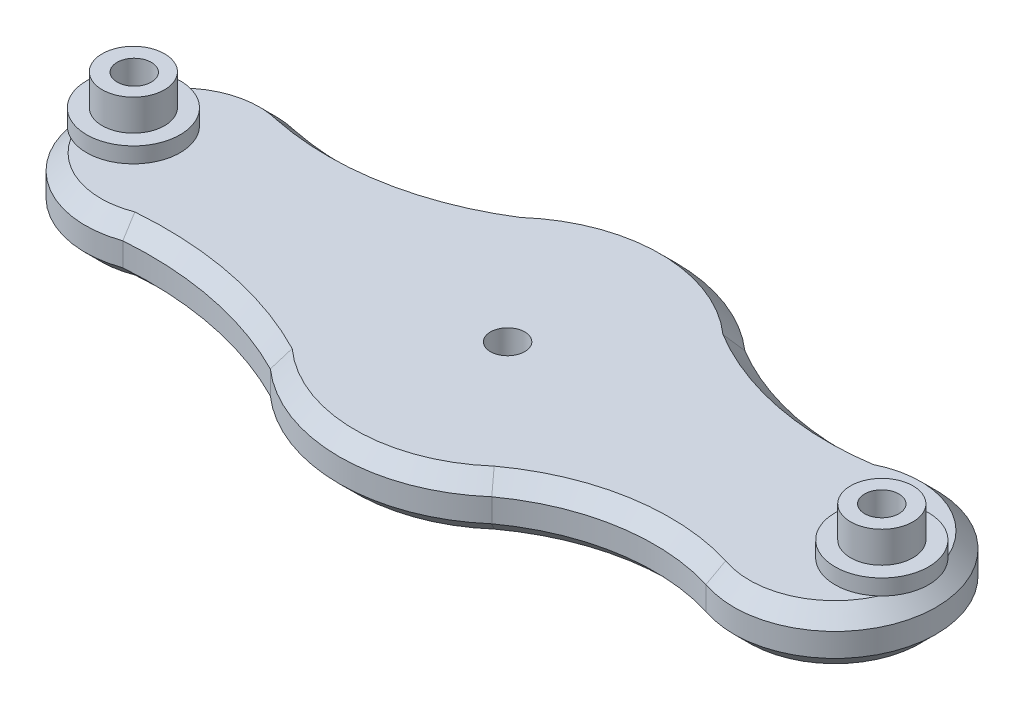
ISO-10303-21;
HEADER;
FILE_DESCRIPTION(('STEP AP214'),'2;1');
FILE_NAME('part.step','',(''),(''),'','','');
FILE_SCHEMA(('AUTOMOTIVE_DESIGN { 1 0 10303 214 1 1 1 1 }'));
ENDSEC;
DATA;
#1=APPLICATION_CONTEXT('core data for automotive mechanical design processes');
#2=APPLICATION_PROTOCOL_DEFINITION('international standard','automotive_design',2000,#1);
#3=PRODUCT_CONTEXT('',#1,'mechanical');
#4=PRODUCT('Part','Part','',(#3));
#5=PRODUCT_RELATED_PRODUCT_CATEGORY('part','',(#4));
#6=PRODUCT_DEFINITION_FORMATION('','',#4);
#7=PRODUCT_DEFINITION_CONTEXT('part definition',#1,'design');
#8=PRODUCT_DEFINITION('design','',#6,#7);
#9=PRODUCT_DEFINITION_SHAPE('','',#8);
#10=(LENGTH_UNIT() NAMED_UNIT(*) SI_UNIT(.MILLI.,.METRE.));
#11=(NAMED_UNIT(*) PLANE_ANGLE_UNIT() SI_UNIT($,.RADIAN.));
#12=(NAMED_UNIT(*) SI_UNIT($,.STERADIAN.) SOLID_ANGLE_UNIT());
#13=UNCERTAINTY_MEASURE_WITH_UNIT(LENGTH_MEASURE(1.E-05),#10,'distance_accuracy_value','');
#14=(GEOMETRIC_REPRESENTATION_CONTEXT(3) GLOBAL_UNCERTAINTY_ASSIGNED_CONTEXT((#13)) GLOBAL_UNIT_ASSIGNED_CONTEXT((#10,
#11,#12)) REPRESENTATION_CONTEXT('',''));
#15=CARTESIAN_POINT('',(0.,0.,0.));
#16=DIRECTION('',(0.,0.,1.));
#17=DIRECTION('',(1.,0.,0.));
#18=AXIS2_PLACEMENT_3D('',#15,#16,#17);
#19=CARTESIAN_POINT('',(0.,0.7,0.));
#20=DIRECTION('',(0.,-1.,0.));
#21=DIRECTION('',(0.,0.,-1.));
#22=AXIS2_PLACEMENT_3D('',#19,#20,#21);
#23=CYLINDRICAL_SURFACE('',#22,1.1);
#24=CARTESIAN_POINT('',(0.,0.,0.));
#25=DIRECTION('',(0.,-1.,0.));
#26=DIRECTION('',(0.,0.,-1.));
#27=AXIS2_PLACEMENT_3D('',#24,#25,#26);
#28=CIRCLE('',#27,1.1);
#29=CARTESIAN_POINT('',(0.,0.,-1.1));
#30=VERTEX_POINT('',#29);
#31=EDGE_CURVE('E344',#30,#30,#28,.T.);
#32=ORIENTED_EDGE('',*,*,#31,.F.);
#33=EDGE_LOOP('',(#32));
#34=FACE_BOUND('',#33,.T.);
#35=CARTESIAN_POINT('',(0.,-1.05,0.));
#36=DIRECTION('',(0.,-1.,0.));
#37=DIRECTION('',(0.,0.,-1.));
#38=AXIS2_PLACEMENT_3D('',#35,#36,#37);
#39=CIRCLE('',#38,1.1);
#40=CARTESIAN_POINT('',(0.,-1.05,-1.1));
#41=VERTEX_POINT('',#40);
#42=EDGE_CURVE('E49',#41,#41,#39,.F.);
#43=ORIENTED_EDGE('',*,*,#42,.F.);
#44=EDGE_LOOP('',(#43));
#45=FACE_BOUND('',#44,.T.);
#46=ADVANCED_FACE('F43',(#34,#45),#23,.F.);
#47=CARTESIAN_POINT('',(24.,-3.5,0.));
#48=DIRECTION('',(0.,1.,0.));
#49=DIRECTION('',(0.,0.,1.));
#50=AXIS2_PLACEMENT_3D('',#47,#48,#49);
#51=CYLINDRICAL_SURFACE('',#50,1.1);
#52=CARTESIAN_POINT('',(24.,6.5,0.));
#53=DIRECTION('',(0.,1.,0.));
#54=DIRECTION('',(0.,0.,1.));
#55=AXIS2_PLACEMENT_3D('',#52,#53,#54);
#56=CIRCLE('',#55,1.1);
#57=CARTESIAN_POINT('',(24.,6.5,1.1));
#58=VERTEX_POINT('',#57);
#59=EDGE_CURVE('E441',#58,#58,#56,.T.);
#60=ORIENTED_EDGE('',*,*,#59,.T.);
#61=EDGE_LOOP('',(#60));
#62=FACE_BOUND('',#61,.T.);
#63=CARTESIAN_POINT('',(24.,2.,0.));
#64=DIRECTION('',(0.,-1.,0.));
#65=DIRECTION('',(0.,0.,-1.));
#66=AXIS2_PLACEMENT_3D('',#63,#64,#65);
#67=CIRCLE('',#66,1.1);
#68=CARTESIAN_POINT('',(24.,2.,-1.1));
#69=VERTEX_POINT('',#68);
#70=EDGE_CURVE('E444',#69,#69,#67,.F.);
#71=ORIENTED_EDGE('',*,*,#70,.F.);
#72=EDGE_LOOP('',(#71));
#73=FACE_BOUND('',#72,.T.);
#74=ADVANCED_FACE('F698',(#62,#73),#51,.F.);
#75=CARTESIAN_POINT('',(-23.9462103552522,-3.5,0.));
#76=DIRECTION('',(0.,1.,0.));
#77=DIRECTION('',(0.,0.,1.));
#78=AXIS2_PLACEMENT_3D('',#75,#76,#77);
#79=CYLINDRICAL_SURFACE('',#78,1.1);
#80=CARTESIAN_POINT('',(-23.9462103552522,6.5,0.));
#81=DIRECTION('',(0.,1.,0.));
#82=DIRECTION('',(0.,0.,1.));
#83=AXIS2_PLACEMENT_3D('',#80,#81,#82);
#84=CIRCLE('',#83,1.1);
#85=CARTESIAN_POINT('',(-23.9462103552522,6.5,1.1));
#86=VERTEX_POINT('',#85);
#87=EDGE_CURVE('E437',#86,#86,#84,.T.);
#88=ORIENTED_EDGE('',*,*,#87,.T.);
#89=EDGE_LOOP('',(#88));
#90=FACE_BOUND('',#89,.T.);
#91=CARTESIAN_POINT('',(-23.9462103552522,2.,0.));
#92=DIRECTION('',(0.,-1.,0.));
#93=DIRECTION('',(0.,0.,-1.));
#94=AXIS2_PLACEMENT_3D('',#91,#92,#93);
#95=CIRCLE('',#94,1.1);
#96=CARTESIAN_POINT('',(-23.9462103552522,2.,-1.1));
#97=VERTEX_POINT('',#96);
#98=EDGE_CURVE('E380',#97,#97,#95,.F.);
#99=ORIENTED_EDGE('',*,*,#98,.F.);
#100=EDGE_LOOP('',(#99));
#101=FACE_BOUND('',#100,.T.);
#102=ADVANCED_FACE('F694',(#90,#101),#79,.F.);
#103=CARTESIAN_POINT('',(-8.63249752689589,3.5,13.9795309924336));
#104=DIRECTION('',(0.,-1.,0.));
#105=DIRECTION('',(0.,0.,-1.));
#106=AXIS2_PLACEMENT_3D('',#103,#104,#105);
#107=PLANE('',#106);
#108=CARTESIAN_POINT('',(0.,3.5,0.));
#109=DIRECTION('',(0.,-1.,0.));
#110=DIRECTION('',(0.,0.,-1.));
#111=AXIS2_PLACEMENT_3D('',#108,#109,#110);
#112=CIRCLE('',#111,1.1);
#113=CARTESIAN_POINT('',(0.,3.5,-1.1));
#114=VERTEX_POINT('',#113);
#115=EDGE_CURVE('E340',#114,#114,#112,.T.);
#116=ORIENTED_EDGE('',*,*,#115,.T.);
#117=EDGE_LOOP('',(#116));
#118=FACE_BOUND('',#117,.T.);
#119=CARTESIAN_POINT('',(24.,3.5,0.));
#120=DIRECTION('',(0.,1.,0.));
#121=DIRECTION('',(0.,0.,1.));
#122=AXIS2_PLACEMENT_3D('',#119,#120,#121);
#123=CIRCLE('',#122,3.);
#124=CARTESIAN_POINT('',(26.0216815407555,3.5,-2.21648454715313));
#125=VERTEX_POINT('',#124);
#126=CARTESIAN_POINT('',(26.0216815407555,3.5,2.21648454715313));
#127=VERTEX_POINT('',#126);
#128=EDGE_CURVE('E449',#125,#127,#123,.T.);
#129=ORIENTED_EDGE('',*,*,#128,.F.);
#130=CARTESIAN_POINT('',(21.,3.5,0.));
#131=DIRECTION('',(0.,-1.,0.));
#132=DIRECTION('',(0.,0.,-1.));
#133=AXIS2_PLACEMENT_3D('',#130,#131,#132);
#134=CIRCLE('',#133,5.48908819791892);
#135=CARTESIAN_POINT('',(18.5443098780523,3.5,-4.90914200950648));
#136=VERTEX_POINT('',#135);
#137=EDGE_CURVE('E568',#125,#136,#134,.F.);
#138=ORIENTED_EDGE('',*,*,#137,.T.);
#139=CARTESIAN_POINT('',(15.8319119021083,3.5,-22.7036045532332));
#140=DIRECTION('',(0.,-1.,0.));
#141=DIRECTION('',(0.,0.,-1.));
#142=AXIS2_PLACEMENT_3D('',#139,#140,#141);
#143=CIRCLE('',#142,18.);
#144=CARTESIAN_POINT('',(6.50828780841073,3.5,-7.30652581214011));
#145=VERTEX_POINT('',#144);
#146=EDGE_CURVE('E566',#136,#145,#143,.T.);
#147=ORIENTED_EDGE('',*,*,#146,.T.);
#148=CARTESIAN_POINT('',(0.,3.5,0.));
#149=DIRECTION('',(0.,-1.,0.));
#150=DIRECTION('',(0.,0.,-1.));
#151=AXIS2_PLACEMENT_3D('',#148,#149,#150);
#152=CIRCLE('',#151,9.78484183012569);
#153=CARTESIAN_POINT('',(-6.50203863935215,3.5,-7.31208747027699));
#154=VERTEX_POINT('',#153);
#155=EDGE_CURVE('E564',#145,#154,#152,.F.);
#156=ORIENTED_EDGE('',*,*,#155,.T.);
#157=CARTESIAN_POINT('',(-16.0825534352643,3.5,-22.5506483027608));
#158=DIRECTION('',(0.,-1.,0.));
#159=DIRECTION('',(0.,0.,-1.));
#160=AXIS2_PLACEMENT_3D('',#157,#158,#159);
#161=CIRCLE('',#160,18.);
#162=CARTESIAN_POINT('',(-19.7329971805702,3.5,-4.92469413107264));
#163=VERTEX_POINT('',#162);
#164=EDGE_CURVE('E561',#154,#163,#161,.T.);
#165=ORIENTED_EDGE('',*,*,#164,.T.);
#166=CARTESIAN_POINT('',(-21.,3.5,0.));
#167=DIRECTION('',(0.,-1.,0.));
#168=DIRECTION('',(0.,0.,-1.));
#169=AXIS2_PLACEMENT_3D('',#166,#167,#168);
#170=CIRCLE('',#169,5.08506720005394);
#171=CARTESIAN_POINT('',(-25.3096514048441,3.5,-2.69903931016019));
#172=VERTEX_POINT('',#171);
#173=EDGE_CURVE('E558',#163,#172,#170,.F.);
#174=ORIENTED_EDGE('',*,*,#173,.T.);
#175=CARTESIAN_POINT('',(-24.,3.5,0.));
#176=DIRECTION('',(0.,1.,0.));
#177=DIRECTION('',(0.,0.,1.));
#178=AXIS2_PLACEMENT_3D('',#175,#176,#177);
#179=CIRCLE('',#178,3.);
#180=CARTESIAN_POINT('',(-25.3096514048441,3.5,2.69903931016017));
#181=VERTEX_POINT('',#180);
#182=EDGE_CURVE('E448',#181,#172,#179,.T.);
#183=ORIENTED_EDGE('',*,*,#182,.F.);
#184=CARTESIAN_POINT('',(-19.1659629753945,3.5,4.74280682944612));
#185=VERTEX_POINT('',#184);
#186=EDGE_CURVE('E557',#181,#185,#170,.F.);
#187=ORIENTED_EDGE('',*,*,#186,.T.);
#188=CARTESIAN_POINT('',(-17.2649950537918,3.5,27.9590619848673));
#189=DIRECTION('',(0.,-1.,0.));
#190=DIRECTION('',(0.,0.,-1.));
#191=AXIS2_PLACEMENT_3D('',#188,#189,#190);
#192=CIRCLE('',#191,23.2939516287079);
#193=CARTESIAN_POINT('',(-6.53251321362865,3.5,7.28487479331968));
#194=VERTEX_POINT('',#193);
#195=EDGE_CURVE('E577',#185,#194,#192,.T.);
#196=ORIENTED_EDGE('',*,*,#195,.T.);
#197=CARTESIAN_POINT('',(0.,3.5,0.));
#198=DIRECTION('',(0.,-1.,0.));
#199=DIRECTION('',(0.,0.,-1.));
#200=AXIS2_PLACEMENT_3D('',#197,#198,#199);
#201=CIRCLE('',#200,9.78484183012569);
#202=CARTESIAN_POINT('',(6.47489252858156,3.5,7.33613633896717));
#203=VERTEX_POINT('',#202);
#204=EDGE_CURVE('E575',#194,#203,#201,.F.);
#205=ORIENTED_EDGE('',*,*,#204,.T.);
#206=CARTESIAN_POINT('',(14.9720423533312,3.5,18.8798009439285));
#207=DIRECTION('',(0.,-1.,0.));
#208=DIRECTION('',(0.,0.,-1.));
#209=AXIS2_PLACEMENT_3D('',#206,#207,#208);
#210=CIRCLE('',#209,14.3337973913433);
#211=CARTESIAN_POINT('',(19.1589532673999,3.5,5.1711349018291));
#212=VERTEX_POINT('',#211);
#213=EDGE_CURVE('E572',#203,#212,#210,.T.);
#214=ORIENTED_EDGE('',*,*,#213,.T.);
#215=EDGE_CURVE('E569',#212,#127,#134,.F.);
#216=ORIENTED_EDGE('',*,*,#215,.T.);
#217=EDGE_LOOP('',(#129,#138,#147,#156,#165,#174,#183,#187,#196,#205,#214,#216));
#218=FACE_BOUND('',#217,.T.);
#219=ADVANCED_FACE('F697',(#118,#218),#107,.F.);
#220=CARTESIAN_POINT('',(-8.63249752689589,0.,13.9795309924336));
#221=DIRECTION('',(0.,-1.,0.));
#222=DIRECTION('',(0.,0.,-1.));
#223=AXIS2_PLACEMENT_3D('',#220,#221,#222);
#224=PLANE('',#223);
#225=DIRECTION('',(0.799707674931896,0.,-0.600389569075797));
#226=VECTOR('',#225,1.);
#227=CARTESIAN_POINT('',(-26.2457264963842,0.,-0.980930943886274));
#228=LINE('',#227,#226);
#229=CARTESIAN_POINT('',(-25.9386475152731,0.,-1.21147395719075));
#230=VERTEX_POINT('',#229);
#231=CARTESIAN_POINT('',(-24.2464573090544,0.,-2.48190486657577));
#232=VERTEX_POINT('',#231);
#233=EDGE_CURVE('E349',#230,#232,#228,.T.);
#234=ORIENTED_EDGE('',*,*,#233,.F.);
#235=CARTESIAN_POINT('',(-21.,0.,0.));
#236=DIRECTION('',(0.,-1.,0.));
#237=DIRECTION('',(0.,0.,-1.));
#238=AXIS2_PLACEMENT_3D('',#235,#236,#237);
#239=CIRCLE('',#238,5.08506720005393);
#240=CARTESIAN_POINT('',(-19.73299718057,0.,-4.92469413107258));
#241=VERTEX_POINT('',#240);
#242=EDGE_CURVE('E517',#230,#241,#239,.T.);
#243=ORIENTED_EDGE('',*,*,#242,.T.);
#244=CARTESIAN_POINT('',(-16.0825534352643,0.,-22.5506483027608));
#245=DIRECTION('',(0.,-1.,0.));
#246=DIRECTION('',(0.,0.,-1.));
#247=AXIS2_PLACEMENT_3D('',#244,#245,#246);
#248=CIRCLE('',#247,18.);
#249=CARTESIAN_POINT('',(-6.5020386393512,0.,-7.31208747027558));
#250=VERTEX_POINT('',#249);
#251=EDGE_CURVE('E525',#241,#250,#248,.F.);
#252=ORIENTED_EDGE('',*,*,#251,.T.);
#253=CARTESIAN_POINT('',(0.,0.,0.));
#254=DIRECTION('',(0.,-1.,0.));
#255=DIRECTION('',(0.,0.,-1.));
#256=AXIS2_PLACEMENT_3D('',#253,#254,#255);
#257=CIRCLE('',#256,9.78484183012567);
#258=CARTESIAN_POINT('',(6.50828780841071,0.,-7.30652581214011));
#259=VERTEX_POINT('',#258);
#260=EDGE_CURVE('E523',#250,#259,#257,.T.);
#261=ORIENTED_EDGE('',*,*,#260,.T.);
#262=CARTESIAN_POINT('',(15.8319119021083,0.,-22.7036045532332));
#263=DIRECTION('',(0.,-1.,0.));
#264=DIRECTION('',(0.,0.,-1.));
#265=AXIS2_PLACEMENT_3D('',#262,#263,#264);
#266=CIRCLE('',#265,18.);
#267=CARTESIAN_POINT('',(18.5443098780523,0.,-4.90914200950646));
#268=VERTEX_POINT('',#267);
#269=EDGE_CURVE('E521',#259,#268,#266,.F.);
#270=ORIENTED_EDGE('',*,*,#269,.T.);
#271=CARTESIAN_POINT('',(21.,0.,0.));
#272=DIRECTION('',(0.,-1.,0.));
#273=DIRECTION('',(0.,0.,-1.));
#274=AXIS2_PLACEMENT_3D('',#271,#272,#273);
#275=CIRCLE('',#274,5.48908819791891);
#276=CARTESIAN_POINT('',(19.1589532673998,0.,5.17113490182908));
#277=VERTEX_POINT('',#276);
#278=EDGE_CURVE('E509',#268,#277,#275,.T.);
#279=ORIENTED_EDGE('',*,*,#278,.T.);
#280=CARTESIAN_POINT('',(14.9720423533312,0.,18.8798009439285));
#281=DIRECTION('',(0.,-1.,0.));
#282=DIRECTION('',(0.,0.,-1.));
#283=AXIS2_PLACEMENT_3D('',#280,#281,#282);
#284=CIRCLE('',#283,14.3337973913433);
#285=CARTESIAN_POINT('',(6.47489252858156,0.,7.33613633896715));
#286=VERTEX_POINT('',#285);
#287=EDGE_CURVE('E511',#277,#286,#284,.F.);
#288=ORIENTED_EDGE('',*,*,#287,.T.);
#289=CARTESIAN_POINT('',(0.,0.,0.));
#290=DIRECTION('',(0.,-1.,0.));
#291=DIRECTION('',(0.,0.,-1.));
#292=AXIS2_PLACEMENT_3D('',#289,#290,#291);
#293=CIRCLE('',#292,9.78484183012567);
#294=CARTESIAN_POINT('',(-6.53251321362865,0.,7.28487479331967));
#295=VERTEX_POINT('',#294);
#296=EDGE_CURVE('E513',#286,#295,#293,.T.);
#297=ORIENTED_EDGE('',*,*,#296,.T.);
#298=CARTESIAN_POINT('',(-17.2649950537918,0.,27.9590619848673));
#299=DIRECTION('',(0.,-1.,0.));
#300=DIRECTION('',(0.,0.,-1.));
#301=AXIS2_PLACEMENT_3D('',#298,#299,#300);
#302=CIRCLE('',#301,23.2939516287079);
#303=CARTESIAN_POINT('',(-19.1659629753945,0.,4.74280682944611));
#304=VERTEX_POINT('',#303);
#305=EDGE_CURVE('E515',#295,#304,#302,.F.);
#306=ORIENTED_EDGE('',*,*,#305,.T.);
#307=CARTESIAN_POINT('',(-25.8450539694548,0.,1.54381360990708));
#308=VERTEX_POINT('',#307);
#309=EDGE_CURVE('E518',#304,#308,#239,.T.);
#310=ORIENTED_EDGE('',*,*,#309,.T.);
#311=DIRECTION('',(-0.91980645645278,0.,-0.392372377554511));
#312=VECTOR('',#311,1.);
#313=CARTESIAN_POINT('',(-23.64596340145,0.,2.48190486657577));
#314=LINE('',#313,#312);
#315=CARTESIAN_POINT('',(-23.64596340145,0.,2.48190486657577));
#316=VERTEX_POINT('',#315);
#317=EDGE_CURVE('E374',#316,#308,#314,.T.);
#318=ORIENTED_EDGE('',*,*,#317,.F.);
#319=DIRECTION('',(-0.799707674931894,0.,0.6003895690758));
#320=VECTOR('',#319,1.);
#321=CARTESIAN_POINT('',(-21.6466942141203,0.,0.980930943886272));
#322=LINE('',#321,#320);
#323=CARTESIAN_POINT('',(-21.6466942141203,0.,0.980930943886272));
#324=VERTEX_POINT('',#323);
#325=EDGE_CURVE('E371',#324,#316,#322,.T.);
#326=ORIENTED_EDGE('',*,*,#325,.F.);
#327=DIRECTION('',(0.120098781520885,0.,0.992761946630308));
#328=VECTOR('',#327,1.);
#329=CARTESIAN_POINT('',(-21.9469411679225,0.,-1.50097392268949));
#330=LINE('',#329,#328);
#331=CARTESIAN_POINT('',(-21.9469411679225,0.,-1.50097392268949));
#332=VERTEX_POINT('',#331);
#333=EDGE_CURVE('E368',#332,#324,#330,.T.);
#334=ORIENTED_EDGE('',*,*,#333,.F.);
#335=DIRECTION('',(0.91980645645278,0.,0.392372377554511));
#336=VECTOR('',#335,1.);
#337=CARTESIAN_POINT('',(-24.2464573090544,0.,-2.48190486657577));
#338=LINE('',#337,#336);
#339=EDGE_CURVE('E365',#232,#332,#338,.T.);
#340=ORIENTED_EDGE('',*,*,#339,.F.);
#341=EDGE_LOOP('',(#234,#243,#252,#261,#270,#279,#288,#297,#306,#310,#318,#326,#334,#340));
#342=FACE_BOUND('',#341,.T.);
#343=DIRECTION('',(0.984800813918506,0.,0.173687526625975));
#344=VECTOR('',#343,1.);
#345=CARTESIAN_POINT('',(23.1450435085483,0.,-2.34926571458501));
#346=LINE('',#345,#344);
#347=CARTESIAN_POINT('',(23.1450435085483,0.,-2.34926571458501));
#348=VERTEX_POINT('',#347);
#349=CARTESIAN_POINT('',(25.6070455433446,0.,-1.91504689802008));
#350=VERTEX_POINT('',#349);
#351=EDGE_CURVE('E70',#348,#350,#346,.T.);
#352=ORIENTED_EDGE('',*,*,#351,.F.);
#353=DIRECTION('',(0.642818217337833,0.,-0.76601875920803));
#354=VECTOR('',#353,1.);
#355=CARTESIAN_POINT('',(21.5379979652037,0.,-0.434218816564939));
#356=LINE('',#355,#354);
#357=CARTESIAN_POINT('',(21.5379979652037,0.,-0.434218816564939));
#358=VERTEX_POINT('',#357);
#359=EDGE_CURVE('E404',#358,#348,#356,.T.);
#360=ORIENTED_EDGE('',*,*,#359,.F.);
#361=DIRECTION('',(-0.341982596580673,0.,-0.939706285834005));
#362=VECTOR('',#361,1.);
#363=CARTESIAN_POINT('',(22.3929544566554,0.,1.91504689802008));
#364=LINE('',#363,#362);
#365=CARTESIAN_POINT('',(22.3929544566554,0.,1.91504689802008));
#366=VERTEX_POINT('',#365);
#367=EDGE_CURVE('E407',#366,#358,#364,.T.);
#368=ORIENTED_EDGE('',*,*,#367,.F.);
#369=DIRECTION('',(-0.984800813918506,0.,-0.173687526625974));
#370=VECTOR('',#369,1.);
#371=CARTESIAN_POINT('',(24.8549564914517,0.,2.34926571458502));
#372=LINE('',#371,#370);
#373=CARTESIAN_POINT('',(24.8549564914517,0.,2.34926571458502));
#374=VERTEX_POINT('',#373);
#375=EDGE_CURVE('E411',#374,#366,#372,.T.);
#376=ORIENTED_EDGE('',*,*,#375,.F.);
#377=DIRECTION('',(-0.642818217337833,0.,0.766018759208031));
#378=VECTOR('',#377,1.);
#379=CARTESIAN_POINT('',(26.4620020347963,0.,0.434218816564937));
#380=LINE('',#379,#378);
#381=CARTESIAN_POINT('',(26.4620020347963,0.,0.434218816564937));
#382=VERTEX_POINT('',#381);
#383=EDGE_CURVE('E414',#382,#374,#380,.T.);
#384=ORIENTED_EDGE('',*,*,#383,.F.);
#385=DIRECTION('',(0.341982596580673,0.,0.939706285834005));
#386=VECTOR('',#385,1.);
#387=CARTESIAN_POINT('',(25.6070455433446,0.,-1.91504689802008));
#388=LINE('',#387,#386);
#389=EDGE_CURVE('E417',#350,#382,#388,.T.);
#390=ORIENTED_EDGE('',*,*,#389,.F.);
#391=EDGE_LOOP('',(#352,#360,#368,#376,#384,#390));
#392=FACE_BOUND('',#391,.T.);
#393=CARTESIAN_POINT('',(0.,0.,0.));
#394=DIRECTION('',(0.,-1.,0.));
#395=DIRECTION('',(0.,0.,-1.));
#396=AXIS2_PLACEMENT_3D('',#393,#394,#395);
#397=CIRCLE('',#396,5.);
#398=CARTESIAN_POINT('',(0.,0.,-5.));
#399=VERTEX_POINT('',#398);
#400=EDGE_CURVE('E455',#399,#399,#397,.T.);
#401=ORIENTED_EDGE('',*,*,#400,.F.);
#402=EDGE_LOOP('',(#401));
#403=FACE_BOUND('',#402,.T.);
#404=ADVANCED_FACE('F777',(#342,#392,#403),#224,.T.);
#405=CARTESIAN_POINT('',(-17.2649950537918,3.5,27.9590619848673));
#406=DIRECTION('',(0.,-1.,0.));
#407=DIRECTION('',(0.,0.,-1.));
#408=AXIS2_PLACEMENT_3D('',#405,#406,#407);
#409=CYLINDRICAL_SURFACE('',#408,22.2939516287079);
#410=DIRECTION('',(0.,-1.,0.));
#411=VECTOR('',#410,1.);
#412=CARTESIAN_POINT('',(-18.9483026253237,3.5,5.7287503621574));
#413=LINE('',#412,#411);
#414=CARTESIAN_POINT('',(-18.9483026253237,2.50000000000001,5.7287503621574));
#415=VERTEX_POINT('',#414);
#416=CARTESIAN_POINT('',(-18.9483026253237,0.999999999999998,5.7287503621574));
#417=VERTEX_POINT('',#416);
#418=EDGE_CURVE('E480',#415,#417,#413,.T.);
#419=ORIENTED_EDGE('',*,*,#418,.T.);
#420=CARTESIAN_POINT('',(-17.2649950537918,0.999999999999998,27.9590619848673));
#421=DIRECTION('',(0.,-1.,0.));
#422=DIRECTION('',(0.,0.,-1.));
#423=AXIS2_PLACEMENT_3D('',#420,#421,#422);
#424=CIRCLE('',#423,22.2939516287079);
#425=CARTESIAN_POINT('',(-7.10191749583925,0.999999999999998,8.11637734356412));
#426=VERTEX_POINT('',#425);
#427=EDGE_CURVE('E543',#417,#426,#424,.T.);
#428=ORIENTED_EDGE('',*,*,#427,.T.);
#429=DIRECTION('',(0.,-1.,0.));
#430=VECTOR('',#429,1.);
#431=CARTESIAN_POINT('',(-7.10191749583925,3.5,8.11637734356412));
#432=LINE('',#431,#430);
#433=CARTESIAN_POINT('',(-7.10191749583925,2.50000000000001,8.11637734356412));
#434=VERTEX_POINT('',#433);
#435=EDGE_CURVE('E501',#434,#426,#432,.T.);
#436=ORIENTED_EDGE('',*,*,#435,.F.);
#437=CARTESIAN_POINT('',(-17.2649950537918,2.50000000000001,27.9590619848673));
#438=DIRECTION('',(0.,-1.,0.));
#439=DIRECTION('',(0.,0.,-1.));
#440=AXIS2_PLACEMENT_3D('',#437,#438,#439);
#441=CIRCLE('',#440,22.2939516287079);
#442=EDGE_CURVE('E540',#434,#415,#441,.F.);
#443=ORIENTED_EDGE('',*,*,#442,.T.);
#444=EDGE_LOOP('',(#419,#428,#436,#443));
#445=FACE_BOUND('',#444,.T.);
#446=ADVANCED_FACE('F781',(#445),#409,.F.);
#447=CARTESIAN_POINT('',(0.,3.5,0.));
#448=DIRECTION('',(0.,-1.,0.));
#449=DIRECTION('',(0.,0.,-1.));
#450=AXIS2_PLACEMENT_3D('',#447,#448,#449);
#451=CYLINDRICAL_SURFACE('',#450,10.7848418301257);
#452=ORIENTED_EDGE('',*,*,#435,.T.);
#453=CARTESIAN_POINT('',(0.,0.999999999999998,0.));
#454=DIRECTION('',(0.,-1.,0.));
#455=DIRECTION('',(0.,0.,-1.));
#456=AXIS2_PLACEMENT_3D('',#453,#454,#455);
#457=CIRCLE('',#456,10.7848418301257);
#458=CARTESIAN_POINT('',(7.10191749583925,0.999999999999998,8.11637734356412));
#459=VERTEX_POINT('',#458);
#460=EDGE_CURVE('E547',#426,#459,#457,.F.);
#461=ORIENTED_EDGE('',*,*,#460,.T.);
#462=DIRECTION('',(0.,-1.,0.));
#463=VECTOR('',#462,1.);
#464=CARTESIAN_POINT('',(7.10191749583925,3.5,8.11637734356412));
#465=LINE('',#464,#463);
#466=CARTESIAN_POINT('',(7.10191749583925,2.50000000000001,8.11637734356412));
#467=VERTEX_POINT('',#466);
#468=EDGE_CURVE('E498',#467,#459,#465,.T.);
#469=ORIENTED_EDGE('',*,*,#468,.F.);
#470=CARTESIAN_POINT('',(0.,2.50000000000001,0.));
#471=DIRECTION('',(0.,-1.,0.));
#472=DIRECTION('',(0.,0.,-1.));
#473=AXIS2_PLACEMENT_3D('',#470,#471,#472);
#474=CIRCLE('',#473,10.7848418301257);
#475=EDGE_CURVE('E545',#467,#434,#474,.T.);
#476=ORIENTED_EDGE('',*,*,#475,.T.);
#477=EDGE_LOOP('',(#452,#461,#469,#476));
#478=FACE_BOUND('',#477,.T.);
#479=ADVANCED_FACE('F807',(#478),#451,.T.);
#480=CARTESIAN_POINT('',(14.9720423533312,3.5,18.8798009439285));
#481=DIRECTION('',(0.,-1.,0.));
#482=DIRECTION('',(0.,0.,-1.));
#483=AXIS2_PLACEMENT_3D('',#480,#481,#482);
#484=CYLINDRICAL_SURFACE('',#483,13.3337973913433);
#485=ORIENTED_EDGE('',*,*,#468,.T.);
#486=CARTESIAN_POINT('',(14.9720423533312,0.999999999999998,18.8798009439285));
#487=DIRECTION('',(0.,-1.,0.));
#488=DIRECTION('',(0.,0.,-1.));
#489=AXIS2_PLACEMENT_3D('',#486,#487,#488);
#490=CIRCLE('',#489,13.3337973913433);
#491=CARTESIAN_POINT('',(18.8463398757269,0.999999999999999,6.12127549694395));
#492=VERTEX_POINT('',#491);
#493=EDGE_CURVE('E551',#459,#492,#490,.T.);
#494=ORIENTED_EDGE('',*,*,#493,.T.);
#495=DIRECTION('',(0.,-1.,0.));
#496=VECTOR('',#495,1.);
#497=CARTESIAN_POINT('',(18.8463398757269,3.5,6.12127549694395));
#498=LINE('',#497,#496);
#499=CARTESIAN_POINT('',(18.8463398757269,2.50000000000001,6.12127549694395));
#500=VERTEX_POINT('',#499);
#501=EDGE_CURVE('E495',#500,#492,#498,.T.);
#502=ORIENTED_EDGE('',*,*,#501,.F.);
#503=CARTESIAN_POINT('',(14.9720423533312,2.50000000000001,18.8798009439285));
#504=DIRECTION('',(0.,-1.,0.));
#505=DIRECTION('',(0.,0.,-1.));
#506=AXIS2_PLACEMENT_3D('',#503,#504,#505);
#507=CIRCLE('',#506,13.3337973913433);
#508=EDGE_CURVE('E549',#500,#467,#507,.F.);
#509=ORIENTED_EDGE('',*,*,#508,.T.);
#510=EDGE_LOOP('',(#485,#494,#502,#509));
#511=FACE_BOUND('',#510,.T.);
#512=ADVANCED_FACE('F803',(#511),#484,.F.);
#513=CARTESIAN_POINT('',(21.,3.5,0.));
#514=DIRECTION('',(0.,-1.,0.));
#515=DIRECTION('',(0.,0.,-1.));
#516=AXIS2_PLACEMENT_3D('',#513,#514,#515);
#517=CYLINDRICAL_SURFACE('',#516,6.48908819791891);
#518=ORIENTED_EDGE('',*,*,#501,.T.);
#519=CARTESIAN_POINT('',(21.,0.999999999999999,0.));
#520=DIRECTION('',(0.,-1.,0.));
#521=DIRECTION('',(0.,0.,-1.));
#522=AXIS2_PLACEMENT_3D('',#519,#520,#521);
#523=CIRCLE('',#522,6.48908819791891);
#524=CARTESIAN_POINT('',(18.2465922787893,0.999999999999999,-5.87596898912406));
#525=VERTEX_POINT('',#524);
#526=EDGE_CURVE('E555',#492,#525,#523,.F.);
#527=ORIENTED_EDGE('',*,*,#526,.T.);
#528=DIRECTION('',(0.,-1.,0.));
#529=VECTOR('',#528,1.);
#530=CARTESIAN_POINT('',(18.2465922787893,3.5,-5.87596898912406));
#531=LINE('',#530,#529);
#532=CARTESIAN_POINT('',(18.2465922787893,2.50000000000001,-5.87596898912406));
#533=VERTEX_POINT('',#532);
#534=EDGE_CURVE('E492',#533,#525,#531,.T.);
#535=ORIENTED_EDGE('',*,*,#534,.F.);
#536=CARTESIAN_POINT('',(21.,2.50000000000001,0.));
#537=DIRECTION('',(0.,-1.,0.));
#538=DIRECTION('',(0.,0.,-1.));
#539=AXIS2_PLACEMENT_3D('',#536,#537,#538);
#540=CIRCLE('',#539,6.48908819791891);
#541=EDGE_CURVE('E553',#533,#500,#540,.T.);
#542=ORIENTED_EDGE('',*,*,#541,.T.);
#543=EDGE_LOOP('',(#518,#527,#535,#542));
#544=FACE_BOUND('',#543,.T.);
#545=ADVANCED_FACE('F799',(#544),#517,.T.);
#546=CARTESIAN_POINT('',(15.8319119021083,3.5,-22.7036045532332));
#547=DIRECTION('',(0.,-1.,0.));
#548=DIRECTION('',(0.,0.,-1.));
#549=AXIS2_PLACEMENT_3D('',#546,#547,#548);
#550=CYLINDRICAL_SURFACE('',#549,17.);
#551=ORIENTED_EDGE('',*,*,#534,.T.);
#552=CARTESIAN_POINT('',(15.8319119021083,0.999999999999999,-22.7036045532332));
#553=DIRECTION('',(0.,-1.,0.));
#554=DIRECTION('',(0.,0.,-1.));
#555=AXIS2_PLACEMENT_3D('',#552,#553,#554);
#556=CIRCLE('',#555,17.);
#557=CARTESIAN_POINT('',(7.10191749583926,0.999999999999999,-8.11637734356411));
#558=VERTEX_POINT('',#557);
#559=EDGE_CURVE('E534',#525,#558,#556,.T.);
#560=ORIENTED_EDGE('',*,*,#559,.T.);
#561=DIRECTION('',(0.,-1.,0.));
#562=VECTOR('',#561,1.);
#563=CARTESIAN_POINT('',(7.10191749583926,3.5,-8.11637734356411));
#564=LINE('',#563,#562);
#565=CARTESIAN_POINT('',(7.10191749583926,2.50000000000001,-8.11637734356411));
#566=VERTEX_POINT('',#565);
#567=EDGE_CURVE('E489',#566,#558,#564,.T.);
#568=ORIENTED_EDGE('',*,*,#567,.F.);
#569=CARTESIAN_POINT('',(15.8319119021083,2.50000000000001,-22.7036045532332));
#570=DIRECTION('',(0.,-1.,0.));
#571=DIRECTION('',(0.,0.,-1.));
#572=AXIS2_PLACEMENT_3D('',#569,#570,#571);
#573=CIRCLE('',#572,17.);
#574=EDGE_CURVE('E532',#566,#533,#573,.F.);
#575=ORIENTED_EDGE('',*,*,#574,.T.);
#576=EDGE_LOOP('',(#551,#560,#568,#575));
#577=FACE_BOUND('',#576,.T.);
#578=ADVANCED_FACE('F795',(#577),#550,.F.);
#579=CARTESIAN_POINT('',(0.,3.5,0.));
#580=DIRECTION('',(0.,-1.,0.));
#581=DIRECTION('',(0.,0.,-1.));
#582=AXIS2_PLACEMENT_3D('',#579,#580,#581);
#583=CYLINDRICAL_SURFACE('',#582,10.7848418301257);
#584=ORIENTED_EDGE('',*,*,#567,.T.);
#585=CARTESIAN_POINT('',(0.,0.999999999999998,0.));
#586=DIRECTION('',(0.,-1.,0.));
#587=DIRECTION('',(0.,0.,-1.));
#588=AXIS2_PLACEMENT_3D('',#585,#586,#587);
#589=CIRCLE('',#588,10.7848418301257);
#590=CARTESIAN_POINT('',(-7.10191749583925,0.999999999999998,-8.11637734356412));
#591=VERTEX_POINT('',#590);
#592=EDGE_CURVE('E530',#558,#591,#589,.F.);
#593=ORIENTED_EDGE('',*,*,#592,.T.);
#594=DIRECTION('',(0.,-1.,0.));
#595=VECTOR('',#594,1.);
#596=CARTESIAN_POINT('',(-7.10191749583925,3.5,-8.11637734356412));
#597=LINE('',#596,#595);
#598=CARTESIAN_POINT('',(-7.10191749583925,2.50000000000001,-8.11637734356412));
#599=VERTEX_POINT('',#598);
#600=EDGE_CURVE('E486',#599,#591,#597,.T.);
#601=ORIENTED_EDGE('',*,*,#600,.F.);
#602=CARTESIAN_POINT('',(0.,2.50000000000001,0.));
#603=DIRECTION('',(0.,-1.,0.));
#604=DIRECTION('',(0.,0.,-1.));
#605=AXIS2_PLACEMENT_3D('',#602,#603,#604);
#606=CIRCLE('',#605,10.7848418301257);
#607=EDGE_CURVE('E528',#599,#566,#606,.T.);
#608=ORIENTED_EDGE('',*,*,#607,.T.);
#609=EDGE_LOOP('',(#584,#593,#601,#608));
#610=FACE_BOUND('',#609,.T.);
#611=ADVANCED_FACE('F791',(#610),#583,.T.);
#612=CARTESIAN_POINT('',(-16.0825534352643,3.5,-22.5506483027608));
#613=DIRECTION('',(0.,-1.,0.));
#614=DIRECTION('',(0.,0.,-1.));
#615=AXIS2_PLACEMENT_3D('',#612,#613,#614);
#616=CYLINDRICAL_SURFACE('',#615,17.);
#617=ORIENTED_EDGE('',*,*,#600,.T.);
#618=CARTESIAN_POINT('',(-16.0825534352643,0.999999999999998,-22.5506483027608));
#619=DIRECTION('',(0.,-1.,0.));
#620=DIRECTION('',(0.,0.,-1.));
#621=AXIS2_PLACEMENT_3D('',#618,#619,#620);
#622=CIRCLE('',#621,17.);
#623=CARTESIAN_POINT('',(-19.5082621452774,0.999999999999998,-5.89938649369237));
#624=VERTEX_POINT('',#623);
#625=EDGE_CURVE('E506',#591,#624,#622,.T.);
#626=ORIENTED_EDGE('',*,*,#625,.T.);
#627=DIRECTION('',(0.,-1.,0.));
#628=VECTOR('',#627,1.);
#629=CARTESIAN_POINT('',(-19.5082621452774,3.5,-5.89938649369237));
#630=LINE('',#629,#628);
#631=CARTESIAN_POINT('',(-19.5082621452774,2.50000000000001,-5.89938649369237));
#632=VERTEX_POINT('',#631);
#633=EDGE_CURVE('E483',#632,#624,#630,.T.);
#634=ORIENTED_EDGE('',*,*,#633,.F.);
#635=CARTESIAN_POINT('',(-16.0825534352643,2.50000000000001,-22.5506483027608));
#636=DIRECTION('',(0.,-1.,0.));
#637=DIRECTION('',(0.,0.,-1.));
#638=AXIS2_PLACEMENT_3D('',#635,#636,#637);
#639=CIRCLE('',#638,17.);
#640=EDGE_CURVE('E504',#632,#599,#639,.F.);
#641=ORIENTED_EDGE('',*,*,#640,.T.);
#642=EDGE_LOOP('',(#617,#626,#634,#641));
#643=FACE_BOUND('',#642,.T.);
#644=ADVANCED_FACE('F787',(#643),#616,.F.);
#645=CARTESIAN_POINT('',(-21.,3.5,0.));
#646=DIRECTION('',(0.,-1.,0.));
#647=DIRECTION('',(0.,0.,-1.));
#648=AXIS2_PLACEMENT_3D('',#645,#646,#647);
#649=CYLINDRICAL_SURFACE('',#648,6.08506720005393);
#650=ORIENTED_EDGE('',*,*,#633,.T.);
#651=CARTESIAN_POINT('',(-21.,0.999999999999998,0.));
#652=DIRECTION('',(0.,-1.,0.));
#653=DIRECTION('',(0.,0.,-1.));
#654=AXIS2_PLACEMENT_3D('',#651,#652,#653);
#655=CIRCLE('',#654,6.08506720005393);
#656=EDGE_CURVE('E538',#624,#417,#655,.F.);
#657=ORIENTED_EDGE('',*,*,#656,.T.);
#658=ORIENTED_EDGE('',*,*,#418,.F.);
#659=CARTESIAN_POINT('',(-21.,2.50000000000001,0.));
#660=DIRECTION('',(0.,-1.,0.));
#661=DIRECTION('',(0.,0.,-1.));
#662=AXIS2_PLACEMENT_3D('',#659,#660,#661);
#663=CIRCLE('',#662,6.08506720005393);
#664=EDGE_CURVE('E536',#415,#632,#663,.T.);
#665=ORIENTED_EDGE('',*,*,#664,.T.);
#666=EDGE_LOOP('',(#650,#657,#658,#665));
#667=FACE_BOUND('',#666,.T.);
#668=ADVANCED_FACE('F783',(#667),#649,.T.);
#669=CARTESIAN_POINT('',(14.9720423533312,0.999999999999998,18.8798009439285));
#670=DIRECTION('',(0.,-1.,0.));
#671=DIRECTION('',(0.,0.,-1.));
#672=AXIS2_PLACEMENT_3D('',#669,#670,#671);
#673=CONICAL_SURFACE('',#672,13.3337973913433,0.785398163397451);
#674=CARTESIAN_POINT('',(7.10191749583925,0.999999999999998,8.11637734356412));
#675=CARTESIAN_POINT('',(6.99765658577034,0.833332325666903,7.98614298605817));
#676=CARTESIAN_POINT('',(6.89327405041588,0.66666515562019,7.85600572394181));
#677=CARTESIAN_POINT('',(6.68426572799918,0.333331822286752,7.59592538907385));
#678=CARTESIAN_POINT('',(6.5796399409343,0.166665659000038,7.46598231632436));
#679=CARTESIAN_POINT('',(6.47489252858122,-2.81883999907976E-13,7.33613633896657));
#680=B_SPLINE_CURVE_WITH_KNOTS('',3,(#674,#675,#676,#677,#678,#679),.UNSPECIFIED.,.F.,.F.,(4,2,
4),(0.,0.707449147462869,1.41489830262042),.UNSPECIFIED.);
#681=EDGE_CURVE('E1378',#286,#459,#680,.F.);
#682=ORIENTED_EDGE('',*,*,#681,.F.);
#683=ORIENTED_EDGE('',*,*,#287,.F.);
#684=CARTESIAN_POINT('',(18.8463398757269,0.999999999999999,6.12127549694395));
#685=CARTESIAN_POINT('',(18.8982309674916,0.833332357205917,5.9628502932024));
#686=CARTESIAN_POINT('',(18.9502276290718,0.666665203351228,5.80445930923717));
#687=CARTESIAN_POINT('',(19.0544320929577,0.333331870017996,5.48774577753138));
#688=CARTESIAN_POINT('',(19.1066398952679,0.166665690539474,5.32942322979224));
#689=CARTESIAN_POINT('',(19.1589532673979,3.65032559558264E-13,5.17113490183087));
#690=B_SPLINE_CURVE_WITH_KNOTS('',3,(#684,#685,#686,#687,#688,#689),.UNSPECIFIED.,.F.,.F.,(4,2,
4),(0.,0.707194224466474,1.41438846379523),.UNSPECIFIED.);
#691=EDGE_CURVE('E474',#492,#277,#690,.T.);
#692=ORIENTED_EDGE('',*,*,#691,.F.);
#693=ORIENTED_EDGE('',*,*,#493,.F.);
#694=EDGE_LOOP('',(#682,#683,#692,#693));
#695=FACE_BOUND('',#694,.T.);
#696=ADVANCED_FACE('F786',(#695),#673,.F.);
#697=CARTESIAN_POINT('',(21.,0.999999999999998,0.));
#698=DIRECTION('',(0.,1.,0.));
#699=DIRECTION('',(0.,0.,1.));
#700=AXIS2_PLACEMENT_3D('',#697,#698,#699);
#701=CONICAL_SURFACE('',#700,6.48908819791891,0.78539816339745);
#702=ORIENTED_EDGE('',*,*,#691,.T.);
#703=ORIENTED_EDGE('',*,*,#278,.F.);
#704=CARTESIAN_POINT('',(18.5443098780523,0.,-4.90914200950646));
#705=CARTESIAN_POINT('',(18.4932920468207,0.166612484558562,-5.06990549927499));
#706=CARTESIAN_POINT('',(18.4429733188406,0.333252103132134,-5.23085620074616));
#707=CARTESIAN_POINT('',(18.3437341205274,0.666585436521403,-5.55313186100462));
#708=CARTESIAN_POINT('',(18.2948136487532,0.833279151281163,-5.71445681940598));
#709=CARTESIAN_POINT('',(18.2465922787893,0.999999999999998,-5.87596898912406));
#710=B_SPLINE_CURVE_WITH_KNOTS('',3,(#704,#705,#706,#707,#708,#709),.UNSPECIFIED.,.F.,.F.,(4,2,
4),(0.,0.711233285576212,1.42246583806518),.UNSPECIFIED.);
#711=EDGE_CURVE('E1523',#525,#268,#710,.F.);
#712=ORIENTED_EDGE('',*,*,#711,.F.);
#713=ORIENTED_EDGE('',*,*,#526,.F.);
#714=EDGE_LOOP('',(#702,#703,#712,#713));
#715=FACE_BOUND('',#714,.T.);
#716=ADVANCED_FACE('F1210',(#715),#701,.T.);
#717=CARTESIAN_POINT('',(0.,0.999999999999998,0.));
#718=DIRECTION('',(0.,1.,0.));
#719=DIRECTION('',(0.,0.,1.));
#720=AXIS2_PLACEMENT_3D('',#717,#718,#719);
#721=CONICAL_SURFACE('',#720,10.7848418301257,0.785398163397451);
#722=ORIENTED_EDGE('',*,*,#681,.T.);
#723=ORIENTED_EDGE('',*,*,#460,.F.);
#724=CARTESIAN_POINT('',(-7.10191749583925,0.999999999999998,8.11637734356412));
#725=CARTESIAN_POINT('',(-7.00763778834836,0.833315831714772,7.97738940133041));
#726=CARTESIAN_POINT('',(-6.91304758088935,0.666640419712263,7.83860355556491));
#727=CARTESIAN_POINT('',(-6.7232461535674,0.33330708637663,7.56143603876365));
#728=CARTESIAN_POINT('',(-6.62803493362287,0.166649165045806,7.42305436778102));
#729=CARTESIAN_POINT('',(-6.53251321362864,0.,7.28487479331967));
#730=B_SPLINE_CURVE_WITH_KNOTS('',3,(#724,#725,#726,#727,#728,#729),.UNSPECIFIED.,.F.,.F.,(4,2,
4),(0.,0.709863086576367,1.41972626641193),.UNSPECIFIED.);
#731=EDGE_CURVE('E827',#295,#426,#730,.F.);
#732=ORIENTED_EDGE('',*,*,#731,.F.);
#733=ORIENTED_EDGE('',*,*,#296,.F.);
#734=EDGE_LOOP('',(#722,#723,#732,#733));
#735=FACE_BOUND('',#734,.T.);
#736=ADVANCED_FACE('F1201',(#735),#721,.T.);
#737=CARTESIAN_POINT('',(15.8319119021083,0.999999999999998,-22.7036045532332));
#738=DIRECTION('',(0.,-1.,0.));
#739=DIRECTION('',(0.,0.,-1.));
#740=AXIS2_PLACEMENT_3D('',#737,#738,#739);
#741=CONICAL_SURFACE('',#740,17.,0.78539816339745);
#742=ORIENTED_EDGE('',*,*,#711,.T.);
#743=ORIENTED_EDGE('',*,*,#269,.F.);
#744=CARTESIAN_POINT('',(6.50828780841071,0.,-7.30652581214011));
#745=CARTESIAN_POINT('',(6.60770368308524,0.166659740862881,-7.44115955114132));
#746=CARTESIAN_POINT('',(6.70688076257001,0.333322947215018,-7.57596405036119));
#747=CARTESIAN_POINT('',(6.90475732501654,0.666656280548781,-7.84591456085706));
#748=CARTESIAN_POINT('',(7.00345680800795,0.833326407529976,-7.98106057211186));
#749=CARTESIAN_POINT('',(7.10191749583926,0.999999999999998,-8.11637734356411));
#750=B_SPLINE_CURVE_WITH_KNOTS('',3,(#744,#745,#746,#747,#748,#749),.UNSPECIFIED.,.F.,.F.,(4,2,
4),(0.,0.708565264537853,1.41713048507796),.UNSPECIFIED.);
#751=EDGE_CURVE('E832',#558,#259,#750,.F.);
#752=ORIENTED_EDGE('',*,*,#751,.F.);
#753=ORIENTED_EDGE('',*,*,#559,.F.);
#754=EDGE_LOOP('',(#742,#743,#752,#753));
#755=FACE_BOUND('',#754,.T.);
#756=ADVANCED_FACE('F1194',(#755),#741,.F.);
#757=CARTESIAN_POINT('',(-17.2649950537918,0.999999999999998,27.9590619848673));
#758=DIRECTION('',(0.,-1.,0.));
#759=DIRECTION('',(0.,0.,-1.));
#760=AXIS2_PLACEMENT_3D('',#757,#758,#759);
#761=CONICAL_SURFACE('',#760,22.2939516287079,0.785398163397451);
#762=ORIENTED_EDGE('',*,*,#731,.T.);
#763=ORIENTED_EDGE('',*,*,#427,.F.);
#764=CARTESIAN_POINT('',(-18.9483026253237,0.999999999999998,5.7287503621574));
#765=CARTESIAN_POINT('',(-18.9832882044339,0.833277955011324,5.56419774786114));
#766=CARTESIAN_POINT('',(-19.0189193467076,0.666583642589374,5.39975952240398));
#767=CARTESIAN_POINT('',(-19.0914727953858,0.333250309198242,5.07111167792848));
#768=CARTESIAN_POINT('',(-19.1283951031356,0.166611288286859,4.90690205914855));
#769=CARTESIAN_POINT('',(-19.1659629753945,0.,4.74280682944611));
#770=B_SPLINE_CURVE_WITH_KNOTS('',3,(#764,#765,#766,#767,#768,#769),.UNSPECIFIED.,.F.,.F.,(4,2,
4),(0.,0.710541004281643,1.42108274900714),.UNSPECIFIED.);
#771=EDGE_CURVE('E616',#304,#417,#770,.F.);
#772=ORIENTED_EDGE('',*,*,#771,.F.);
#773=ORIENTED_EDGE('',*,*,#305,.F.);
#774=EDGE_LOOP('',(#762,#763,#772,#773));
#775=FACE_BOUND('',#774,.T.);
#776=ADVANCED_FACE('F823',(#775),#761,.F.);
#777=CARTESIAN_POINT('',(0.,0.999999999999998,0.));
#778=DIRECTION('',(0.,1.,0.));
#779=DIRECTION('',(0.,0.,1.));
#780=AXIS2_PLACEMENT_3D('',#777,#778,#779);
#781=CONICAL_SURFACE('',#780,10.7848418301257,0.785398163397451);
#782=ORIENTED_EDGE('',*,*,#751,.T.);
#783=ORIENTED_EDGE('',*,*,#260,.F.);
#784=CARTESIAN_POINT('',(-6.50203863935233,0.,-7.31208747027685));
#785=CARTESIAN_POINT('',(-6.60244662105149,0.166661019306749,-7.44582346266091));
#786=CARTESIAN_POINT('',(-6.70264051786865,0.333324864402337,-7.57971561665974));
#787=CARTESIAN_POINT('',(-6.9026001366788,0.666658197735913,-7.84781224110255));
#788=CARTESIAN_POINT('',(-7.00236585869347,0.833327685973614,-7.98201671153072));
#789=CARTESIAN_POINT('',(-7.1019174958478,0.999999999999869,-8.11637734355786));
#790=B_SPLINE_CURVE_WITH_KNOTS('',3,(#784,#785,#786,#787,#788,#789),.UNSPECIFIED.,.F.,.F.,(4,2,
4),(0.,0.708297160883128,1.41659428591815),.UNSPECIFIED.);
#791=EDGE_CURVE('E589',#591,#250,#790,.F.);
#792=ORIENTED_EDGE('',*,*,#791,.F.);
#793=ORIENTED_EDGE('',*,*,#592,.F.);
#794=EDGE_LOOP('',(#782,#783,#792,#793));
#795=FACE_BOUND('',#794,.T.);
#796=ADVANCED_FACE('F608',(#795),#781,.T.);
#797=CARTESIAN_POINT('',(-21.,0.999999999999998,0.));
#798=DIRECTION('',(0.,1.,0.));
#799=DIRECTION('',(0.,0.,1.));
#800=AXIS2_PLACEMENT_3D('',#797,#798,#799);
#801=CONICAL_SURFACE('',#800,6.08506720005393,0.785398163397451);
#802=CARTESIAN_POINT('',(-26.2464264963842,0.252177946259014,-0.98040541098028));
#803=CARTESIAN_POINT('',(-26.1734637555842,0.190531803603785,-1.0351830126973));
#804=CARTESIAN_POINT('',(-26.1000336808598,0.129736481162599,-1.09031147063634));
#805=CARTESIAN_POINT('',(-25.952091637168,0.0101764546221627,-1.20138063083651));
#806=CARTESIAN_POINT('',(-25.8775793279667,-0.0485875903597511,-1.25732158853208));
#807=CARTESIAN_POINT('',(-25.7269238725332,-0.164059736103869,-1.37042787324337));
#808=CARTESIAN_POINT('',(-25.6507736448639,-0.220753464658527,-1.42759851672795));
#809=CARTESIAN_POINT('',(-25.4971516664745,-0.331242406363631,-1.54293195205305));
#810=CARTESIAN_POINT('',(-25.4196800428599,-0.385037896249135,-1.6010946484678));
#811=CARTESIAN_POINT('',(-25.1904569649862,-0.53770761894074,-1.77318646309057));
#812=CARTESIAN_POINT('',(-25.0366852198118,-0.631934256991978,-1.88863233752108));
#813=CARTESIAN_POINT('',(-24.7230988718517,-0.802299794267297,-2.12406082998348));
#814=CARTESIAN_POINT('',(-24.5632998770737,-0.878482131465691,-2.24403173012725));
#815=CARTESIAN_POINT('',(-24.3171099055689,-0.974980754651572,-2.42886163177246));
#816=CARTESIAN_POINT('',(-24.2329964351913,-1.004407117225,-2.49201076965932));
#817=CARTESIAN_POINT('',(-24.0633295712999,-1.055848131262,-2.61939008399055));
#818=CARTESIAN_POINT('',(-23.9777764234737,-1.0778640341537,-2.68362007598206));
#819=CARTESIAN_POINT('',(-23.8041029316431,-1.11392252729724,-2.81400741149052));
#820=CARTESIAN_POINT('',(-23.7159635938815,-1.12782527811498,-2.88017901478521));
#821=CARTESIAN_POINT('',(-23.583246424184,-1.14179136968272,-2.97981792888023));
#822=CARTESIAN_POINT('',(-23.5388875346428,-1.14529876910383,-3.01312086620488));
#823=CARTESIAN_POINT('',(-23.4500858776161,-1.1499759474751,-3.07978971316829));
#824=CARTESIAN_POINT('',(-23.4056431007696,-1.15114544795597,-3.11315562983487));
#825=CARTESIAN_POINT('',(-23.361195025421,-1.15112962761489,-3.14652552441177));
#826=B_SPLINE_CURVE_WITH_KNOTS('',3,(#802,#803,#804,#805,#806,#807,#808,#809,#810,#811,#812,
#813,#814,#815,#816,#817,#818,#819,#820,#821,#822,#823,#824,#825),.UNSPECIFIED.,.F.,.F.,(4,2,2,
2,2,2,2,2,2,2,2,4),(0.,0.330338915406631,0.660784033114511,0.993202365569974,1.32558890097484,
1.96735531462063,2.60756073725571,2.93499385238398,3.26237164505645,3.59523713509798,
3.76193267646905,3.9286480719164),.UNSPECIFIED.);
#827=CARTESIAN_POINT('',(-26.2457264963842,0.251586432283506,-0.980930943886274));
#828=VERTEX_POINT('',#827);
#829=EDGE_CURVE('E11',#828,#230,#826,.T.);
#830=ORIENTED_EDGE('',*,*,#829,.F.);
#831=CARTESIAN_POINT('',(-25.9454553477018,0.08320637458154,1.50117392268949));
#832=CARTESIAN_POINT('',(-25.9607218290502,0.0610981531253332,1.37497795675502));
#833=CARTESIAN_POINT('',(-25.9760862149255,0.0435170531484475,1.24797269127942));
#834=CARTESIAN_POINT('',(-26.0069297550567,0.0178013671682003,0.993013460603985));
#835=CARTESIAN_POINT('',(-26.0224089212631,0.00966777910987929,0.865059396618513));
#836=CARTESIAN_POINT('',(-26.0531418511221,0.00329726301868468,0.611014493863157));
#837=CARTESIAN_POINT('',(-26.0683951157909,0.00489912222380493,0.48492777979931));
#838=CARTESIAN_POINT('',(-26.0988390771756,0.0175354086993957,0.233271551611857));
#839=CARTESIAN_POINT('',(-26.1140297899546,0.0285672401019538,0.107701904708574));
#840=CARTESIAN_POINT('',(-26.1487925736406,0.0643059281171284,-0.179654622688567));
#841=CARTESIAN_POINT('',(-26.1683197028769,0.0921106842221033,-0.34107000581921));
#842=CARTESIAN_POINT('',(-26.1974439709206,0.144233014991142,-0.581817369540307));
#843=CARTESIAN_POINT('',(-26.2071781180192,0.163479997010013,-0.662281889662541));
#844=CARTESIAN_POINT('',(-26.2265428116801,0.205203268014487,-0.822354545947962));
#845=CARTESIAN_POINT('',(-26.236173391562,0.227678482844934,-0.901962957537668));
#846=CARTESIAN_POINT('',(-26.2457506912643,0.251646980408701,-0.981130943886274));
#847=B_SPLINE_CURVE_WITH_KNOTS('',3,(#831,#832,#833,#834,#835,#836,#837,#838,#839,#840,#841,
#842,#843,#844,#845,#846),.UNSPECIFIED.,.F.,.F.,(4,2,2,2,2,2,2,4),(0.,0.387033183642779,
0.774107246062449,1.15478927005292,1.53536653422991,2.02948521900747,2.27934660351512,
2.52912504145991),.UNSPECIFIED.);
#848=CARTESIAN_POINT('',(-25.9454795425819,0.0831714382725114,1.50097392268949));
#849=VERTEX_POINT('',#848);
#850=EDGE_CURVE('E54',#849,#828,#847,.T.);
#851=ORIENTED_EDGE('',*,*,#850,.F.);
#852=CARTESIAN_POINT('',(-25.8448110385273,-0.000199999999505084,1.54391723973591));
#853=CARTESIAN_POINT('',(-25.8616588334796,0.0136710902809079,1.5367302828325));
#854=CARTESIAN_POINT('',(-25.8784884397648,0.0275681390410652,1.5295510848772));
#855=CARTESIAN_POINT('',(-25.9121112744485,0.055414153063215,1.51520820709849));
#856=CARTESIAN_POINT('',(-25.9289045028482,0.0693631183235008,1.50804452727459));
#857=CARTESIAN_POINT('',(-25.9456795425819,0.0833380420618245,1.50088860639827));
#858=B_SPLINE_CURVE_WITH_KNOTS('',3,(#852,#853,#854,#855,#856,#857),.UNSPECIFIED.,.F.,.F.,(4,2,
4),(0.,0.0689285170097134,0.137857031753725),.UNSPECIFIED.);
#859=EDGE_CURVE('E623',#308,#849,#858,.T.);
#860=ORIENTED_EDGE('',*,*,#859,.F.);
#861=ORIENTED_EDGE('',*,*,#309,.F.);
#862=ORIENTED_EDGE('',*,*,#771,.T.);
#863=ORIENTED_EDGE('',*,*,#656,.F.);
#864=CARTESIAN_POINT('',(-19.5082621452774,0.999999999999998,-5.89938649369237));
#865=CARTESIAN_POINT('',(-19.5454963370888,0.833331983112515,-5.73688805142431));
#866=CARTESIAN_POINT('',(-19.5828413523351,0.666664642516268,-5.57441446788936));
#867=CARTESIAN_POINT('',(-19.6577530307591,0.33333130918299,-5.249517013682));
#868=CARTESIAN_POINT('',(-19.695319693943,0.166665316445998,-5.087093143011));
#869=CARTESIAN_POINT('',(-19.732997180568,2.80083504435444E-13,-4.92469413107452));
#870=B_SPLINE_CURVE_WITH_KNOTS('',3,(#864,#865,#866,#867,#868,#869),.UNSPECIFIED.,.F.,.F.,(4,2,
4),(0.,0.707200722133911,1.41440146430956),.UNSPECIFIED.);
#871=EDGE_CURVE('E581',#241,#624,#870,.F.);
#872=ORIENTED_EDGE('',*,*,#871,.F.);
#873=ORIENTED_EDGE('',*,*,#242,.F.);
#874=EDGE_LOOP('',(#830,#851,#860,#861,#862,#863,#872,#873));
#875=FACE_BOUND('',#874,.T.);
#876=ADVANCED_FACE('F602',(#875),#801,.T.);
#877=CARTESIAN_POINT('',(-16.0825534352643,0.999999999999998,-22.5506483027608));
#878=DIRECTION('',(0.,-1.,0.));
#879=DIRECTION('',(0.,0.,-1.));
#880=AXIS2_PLACEMENT_3D('',#877,#878,#879);
#881=CONICAL_SURFACE('',#880,17.,0.785398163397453);
#882=ORIENTED_EDGE('',*,*,#791,.T.);
#883=ORIENTED_EDGE('',*,*,#251,.F.);
#884=ORIENTED_EDGE('',*,*,#871,.T.);
#885=ORIENTED_EDGE('',*,*,#625,.F.);
#886=EDGE_LOOP('',(#882,#883,#884,#885));
#887=FACE_BOUND('',#886,.T.);
#888=ADVANCED_FACE('F598',(#887),#881,.F.);
#889=CARTESIAN_POINT('',(15.8319119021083,3.5,-22.7036045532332));
#890=DIRECTION('',(0.,1.,0.));
#891=DIRECTION('',(0.,0.,1.));
#892=AXIS2_PLACEMENT_3D('',#889,#890,#891);
#893=CONICAL_SURFACE('',#892,18.,0.785398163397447);
#894=CARTESIAN_POINT('',(18.5443098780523,3.5,-4.90914200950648));
#895=CARTESIAN_POINT('',(18.4932920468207,3.33338751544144,-5.069905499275));
#896=CARTESIAN_POINT('',(18.4429733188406,3.16674789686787,-5.23085620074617));
#897=CARTESIAN_POINT('',(18.3437341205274,2.8334145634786,-5.55313186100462));
#898=CARTESIAN_POINT('',(18.2948136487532,2.66672084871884,-5.71445681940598));
#899=CARTESIAN_POINT('',(18.2465922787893,2.50000000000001,-5.87596898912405));
#900=B_SPLINE_CURVE_WITH_KNOTS('',3,(#894,#895,#896,#897,#898,#899),.UNSPECIFIED.,.F.,.F.,(4,2,
4),(0.,0.711233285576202,1.42246583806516),.UNSPECIFIED.);
#901=EDGE_CURVE('E1450',#533,#136,#900,.F.);
#902=ORIENTED_EDGE('',*,*,#901,.F.);
#903=ORIENTED_EDGE('',*,*,#574,.F.);
#904=CARTESIAN_POINT('',(6.50828780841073,3.5,-7.30652581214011));
#905=CARTESIAN_POINT('',(6.60770368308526,3.33334025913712,-7.44115955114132));
#906=CARTESIAN_POINT('',(6.70688076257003,3.16667705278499,-7.57596405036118));
#907=CARTESIAN_POINT('',(6.90475732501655,2.83334371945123,-7.84591456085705));
#908=CARTESIAN_POINT('',(7.00345680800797,2.66667359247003,-7.98106057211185));
#909=CARTESIAN_POINT('',(7.10191749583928,2.50000000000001,-8.1163773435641));
#910=B_SPLINE_CURVE_WITH_KNOTS('',3,(#904,#905,#906,#907,#908,#909),.UNSPECIFIED.,.F.,.F.,(4,2,
4),(0.,0.708565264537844,1.41713048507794),.UNSPECIFIED.);
#911=EDGE_CURVE('E590',#145,#566,#910,.T.);
#912=ORIENTED_EDGE('',*,*,#911,.F.);
#913=ORIENTED_EDGE('',*,*,#146,.F.);
#914=EDGE_LOOP('',(#902,#903,#912,#913));
#915=FACE_BOUND('',#914,.T.);
#916=ADVANCED_FACE('F46',(#915),#893,.F.);
#917=CARTESIAN_POINT('',(0.,3.5,0.));
#918=DIRECTION('',(0.,-1.,0.));
#919=DIRECTION('',(0.,0.,-1.));
#920=AXIS2_PLACEMENT_3D('',#917,#918,#919);
#921=CONICAL_SURFACE('',#920,9.78484183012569,0.785398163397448);
#922=ORIENTED_EDGE('',*,*,#911,.T.);
#923=ORIENTED_EDGE('',*,*,#607,.F.);
#924=CARTESIAN_POINT('',(-6.50203863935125,3.5,-7.31208747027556));
#925=CARTESIAN_POINT('',(-6.60244662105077,3.33333898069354,-7.44582346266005));
#926=CARTESIAN_POINT('',(-6.70264051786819,3.16667513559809,-7.57971561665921));
#927=CARTESIAN_POINT('',(-6.90260013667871,2.83334180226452,-7.84781224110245));
#928=CARTESIAN_POINT('',(-7.00236585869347,2.66667231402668,-7.98201671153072));
#929=CARTESIAN_POINT('',(-7.10191749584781,2.50000000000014,-8.11637734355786));
#930=B_SPLINE_CURVE_WITH_KNOTS('',3,(#924,#925,#926,#927,#928,#929),.UNSPECIFIED.,.F.,.F.,(4,2,
4),(0.,0.708297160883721,1.41659428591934),.UNSPECIFIED.);
#931=EDGE_CURVE('E1437',#154,#599,#930,.T.);
#932=ORIENTED_EDGE('',*,*,#931,.F.);
#933=ORIENTED_EDGE('',*,*,#155,.F.);
#934=EDGE_LOOP('',(#922,#923,#932,#933));
#935=FACE_BOUND('',#934,.T.);
#936=ADVANCED_FACE('F1154',(#935),#921,.T.);
#937=CARTESIAN_POINT('',(21.,3.5,0.));
#938=DIRECTION('',(0.,-1.,0.));
#939=DIRECTION('',(0.,0.,-1.));
#940=AXIS2_PLACEMENT_3D('',#937,#938,#939);
#941=CONICAL_SURFACE('',#940,5.48908819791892,0.785398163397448);
#942=ORIENTED_EDGE('',*,*,#901,.T.);
#943=ORIENTED_EDGE('',*,*,#137,.F.);
#944=EDGE_CURVE('E573',#127,#125,#134,.F.);
#945=ORIENTED_EDGE('',*,*,#944,.F.);
#946=ORIENTED_EDGE('',*,*,#215,.F.);
#947=CARTESIAN_POINT('',(19.158953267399,3.5,5.17113490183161));
#948=CARTESIAN_POINT('',(19.1066398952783,3.33333430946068,5.32942322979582));
#949=CARTESIAN_POINT('',(19.0544320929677,3.16666812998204,5.4877457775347));
#950=CARTESIAN_POINT('',(18.9502276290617,2.8333347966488,5.80445930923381));
#951=CARTESIAN_POINT('',(18.8982309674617,2.66666764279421,5.96285029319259));
#952=CARTESIAN_POINT('',(18.8463398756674,2.50000000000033,6.12127549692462));
#953=B_SPLINE_CURVE_WITH_KNOTS('',3,(#947,#948,#949,#950,#951,#952),.UNSPECIFIED.,.F.,.F.,(4,2,
4),(0.,0.707194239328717,1.41438846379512),.UNSPECIFIED.);
#954=EDGE_CURVE('E1430',#500,#212,#953,.F.);
#955=ORIENTED_EDGE('',*,*,#954,.F.);
#956=ORIENTED_EDGE('',*,*,#541,.F.);
#957=EDGE_LOOP('',(#942,#943,#945,#946,#955,#956));
#958=FACE_BOUND('',#957,.T.);
#959=ADVANCED_FACE('F1145',(#958),#941,.T.);
#960=CARTESIAN_POINT('',(-16.0825534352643,3.5,-22.5506483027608));
#961=DIRECTION('',(0.,1.,0.));
#962=DIRECTION('',(0.,0.,1.));
#963=AXIS2_PLACEMENT_3D('',#960,#961,#962);
#964=CONICAL_SURFACE('',#963,18.,0.785398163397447);
#965=ORIENTED_EDGE('',*,*,#931,.T.);
#966=ORIENTED_EDGE('',*,*,#640,.F.);
#967=CARTESIAN_POINT('',(-19.7329971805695,3.5,-4.92469413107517));
#968=CARTESIAN_POINT('',(-19.6953196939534,3.3333346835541,-5.0870931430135));
#969=CARTESIAN_POINT('',(-19.6577530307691,3.16666869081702,-5.24951701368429));
#970=CARTESIAN_POINT('',(-19.5828413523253,2.83333535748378,-5.57441446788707));
#971=CARTESIAN_POINT('',(-19.5454963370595,2.66666801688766,-5.73688805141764));
#972=CARTESIAN_POINT('',(-19.5082621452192,2.50000000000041,-5.89938649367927));
#973=B_SPLINE_CURVE_WITH_KNOTS('',3,(#967,#968,#969,#970,#971,#972),.UNSPECIFIED.,.F.,.F.,(4,2,
4),(0.,0.707200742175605,1.41440146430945),.UNSPECIFIED.);
#974=EDGE_CURVE('E1417',#163,#632,#973,.T.);
#975=ORIENTED_EDGE('',*,*,#974,.F.);
#976=ORIENTED_EDGE('',*,*,#164,.F.);
#977=EDGE_LOOP('',(#965,#966,#975,#976));
#978=FACE_BOUND('',#977,.T.);
#979=ADVANCED_FACE('F1136',(#978),#964,.F.);
#980=CARTESIAN_POINT('',(14.9720423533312,3.5,18.8798009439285));
#981=DIRECTION('',(0.,1.,0.));
#982=DIRECTION('',(0.,0.,1.));
#983=AXIS2_PLACEMENT_3D('',#980,#981,#982);
#984=CONICAL_SURFACE('',#983,14.3337973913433,0.785398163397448);
#985=ORIENTED_EDGE('',*,*,#954,.T.);
#986=ORIENTED_EDGE('',*,*,#213,.F.);
#987=CARTESIAN_POINT('',(6.474892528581,3.5,7.3361363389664));
#988=CARTESIAN_POINT('',(6.57963994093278,3.33333434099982,7.46598231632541));
#989=CARTESIAN_POINT('',(6.68426572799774,3.1666681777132,7.59592538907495));
#990=CARTESIAN_POINT('',(6.89327405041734,2.83333484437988,7.8560057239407));
#991=CARTESIAN_POINT('',(6.99765658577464,2.66666767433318,7.9861429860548));
#992=CARTESIAN_POINT('',(7.10191749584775,2.50000000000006,8.11637734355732));
#993=B_SPLINE_CURVE_WITH_KNOTS('',3,(#987,#988,#989,#990,#991,#992),.UNSPECIFIED.,.F.,.F.,(4,2,
4),(0.,0.707449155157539,1.41489830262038),.UNSPECIFIED.);
#994=EDGE_CURVE('E1410',#467,#203,#993,.F.);
#995=ORIENTED_EDGE('',*,*,#994,.F.);
#996=ORIENTED_EDGE('',*,*,#508,.F.);
#997=EDGE_LOOP('',(#985,#986,#995,#996));
#998=FACE_BOUND('',#997,.T.);
#999=ADVANCED_FACE('F1127',(#998),#984,.F.);
#1000=CARTESIAN_POINT('',(-21.,3.5,0.));
#1001=DIRECTION('',(0.,-1.,0.));
#1002=DIRECTION('',(0.,0.,-1.));
#1003=AXIS2_PLACEMENT_3D('',#1000,#1001,#1002);
#1004=CONICAL_SURFACE('',#1003,5.08506720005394,0.785398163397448);
#1005=ORIENTED_EDGE('',*,*,#974,.T.);
#1006=ORIENTED_EDGE('',*,*,#664,.F.);
#1007=CARTESIAN_POINT('',(-18.9483026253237,2.50000000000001,5.7287503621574));
#1008=CARTESIAN_POINT('',(-18.9832882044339,2.66672204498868,5.56419774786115));
#1009=CARTESIAN_POINT('',(-19.0189193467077,2.83341635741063,5.39975952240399));
#1010=CARTESIAN_POINT('',(-19.0914727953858,3.16674969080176,5.07111167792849));
#1011=CARTESIAN_POINT('',(-19.1283951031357,3.33338871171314,4.90690205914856));
#1012=CARTESIAN_POINT('',(-19.1659629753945,3.5,4.74280682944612));
#1013=B_SPLINE_CURVE_WITH_KNOTS('',3,(#1007,#1008,#1009,#1010,#1011,#1012),.UNSPECIFIED.,.F.,
.F.,(4,2,4),(0.,0.710541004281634,1.42108274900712),.UNSPECIFIED.);
#1014=EDGE_CURVE('E1397',#185,#415,#1013,.F.);
#1015=ORIENTED_EDGE('',*,*,#1014,.F.);
#1016=ORIENTED_EDGE('',*,*,#186,.F.);
#1017=EDGE_CURVE('E562',#172,#181,#170,.F.);
#1018=ORIENTED_EDGE('',*,*,#1017,.F.);
#1019=ORIENTED_EDGE('',*,*,#173,.F.);
#1020=EDGE_LOOP('',(#1005,#1006,#1015,#1016,#1018,#1019));
#1021=FACE_BOUND('',#1020,.T.);
#1022=ADVANCED_FACE('F1118',(#1021),#1004,.T.);
#1023=CARTESIAN_POINT('',(0.,3.5,0.));
#1024=DIRECTION('',(0.,-1.,0.));
#1025=DIRECTION('',(0.,0.,-1.));
#1026=AXIS2_PLACEMENT_3D('',#1023,#1024,#1025);
#1027=CONICAL_SURFACE('',#1026,9.78484183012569,0.785398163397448);
#1028=ORIENTED_EDGE('',*,*,#994,.T.);
#1029=ORIENTED_EDGE('',*,*,#204,.F.);
#1030=CARTESIAN_POINT('',(-6.53251321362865,3.5,7.28487479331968));
#1031=CARTESIAN_POINT('',(-6.6280349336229,3.33335083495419,7.42305436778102));
#1032=CARTESIAN_POINT('',(-6.72324615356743,3.16669291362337,7.56143603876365));
#1033=CARTESIAN_POINT('',(-6.91304758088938,2.83335958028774,7.8386035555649));
#1034=CARTESIAN_POINT('',(-7.00763778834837,2.66668416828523,7.97738940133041));
#1035=CARTESIAN_POINT('',(-7.10191749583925,2.50000000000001,8.11637734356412));
#1036=B_SPLINE_CURVE_WITH_KNOTS('',3,(#1030,#1031,#1032,#1033,#1034,#1035),.UNSPECIFIED.,.F.,
.F.,(4,2,4),(0.,0.709863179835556,1.41972626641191),.UNSPECIFIED.);
#1037=EDGE_CURVE('E1391',#434,#194,#1036,.F.);
#1038=ORIENTED_EDGE('',*,*,#1037,.F.);
#1039=ORIENTED_EDGE('',*,*,#475,.F.);
#1040=EDGE_LOOP('',(#1028,#1029,#1038,#1039));
#1041=FACE_BOUND('',#1040,.T.);
#1042=ADVANCED_FACE('F1109',(#1041),#1027,.T.);
#1043=CARTESIAN_POINT('',(-17.2649950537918,3.5,27.9590619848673));
#1044=DIRECTION('',(0.,1.,0.));
#1045=DIRECTION('',(0.,0.,1.));
#1046=AXIS2_PLACEMENT_3D('',#1043,#1044,#1045);
#1047=CONICAL_SURFACE('',#1046,23.2939516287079,0.785398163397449);
#1048=ORIENTED_EDGE('',*,*,#1014,.T.);
#1049=ORIENTED_EDGE('',*,*,#442,.F.);
#1050=ORIENTED_EDGE('',*,*,#1037,.T.);
#1051=ORIENTED_EDGE('',*,*,#195,.F.);
#1052=EDGE_LOOP('',(#1048,#1049,#1050,#1051));
#1053=FACE_BOUND('',#1052,.T.);
#1054=ADVANCED_FACE('F735',(#1053),#1047,.F.);
#1055=CARTESIAN_POINT('',(0.,-0.5,0.));
#1056=DIRECTION('',(0.,-1.,0.));
#1057=DIRECTION('',(0.,0.,-1.));
#1058=AXIS2_PLACEMENT_3D('',#1055,#1056,#1057);
#1059=PLANE('',#1058);
#1060=CARTESIAN_POINT('',(0.,-0.5,0.));
#1061=DIRECTION('',(0.,-1.,0.));
#1062=DIRECTION('',(0.,0.,-1.));
#1063=AXIS2_PLACEMENT_3D('',#1060,#1061,#1062);
#1064=CIRCLE('',#1063,3.25);
#1065=CARTESIAN_POINT('',(0.,-0.5,3.25));
#1066=VERTEX_POINT('',#1065);
#1067=EDGE_CURVE('E462',#1066,#1066,#1064,.T.);
#1068=ORIENTED_EDGE('',*,*,#1067,.F.);
#1069=EDGE_LOOP('',(#1068));
#1070=FACE_BOUND('',#1069,.T.);
#1071=CARTESIAN_POINT('',(0.,-0.5,0.));
#1072=DIRECTION('',(0.,-1.,0.));
#1073=DIRECTION('',(0.,0.,-1.));
#1074=AXIS2_PLACEMENT_3D('',#1071,#1072,#1073);
#1075=CIRCLE('',#1074,5.);
#1076=CARTESIAN_POINT('',(0.,-0.5,-5.));
#1077=VERTEX_POINT('',#1076);
#1078=EDGE_CURVE('E459',#1077,#1077,#1075,.T.);
#1079=ORIENTED_EDGE('',*,*,#1078,.T.);
#1080=EDGE_LOOP('',(#1079));
#1081=FACE_BOUND('',#1080,.T.);
#1082=ADVANCED_FACE('F731',(#1070,#1081),#1059,.T.);
#1083=CARTESIAN_POINT('',(0.,-0.5,0.));
#1084=DIRECTION('',(0.,1.,0.));
#1085=DIRECTION('',(0.,0.,1.));
#1086=AXIS2_PLACEMENT_3D('',#1083,#1084,#1085);
#1087=CYLINDRICAL_SURFACE('',#1086,5.);
#1088=ORIENTED_EDGE('',*,*,#1078,.F.);
#1089=EDGE_LOOP('',(#1088));
#1090=FACE_BOUND('',#1089,.T.);
#1091=ORIENTED_EDGE('',*,*,#400,.T.);
#1092=EDGE_LOOP('',(#1091));
#1093=FACE_BOUND('',#1092,.T.);
#1094=ADVANCED_FACE('F734',(#1090,#1093),#1087,.T.);
#1095=CARTESIAN_POINT('',(0.,-4.3,0.));
#1096=DIRECTION('',(0.,-1.,0.));
#1097=DIRECTION('',(0.,0.,-1.));
#1098=AXIS2_PLACEMENT_3D('',#1095,#1096,#1097);
#1099=PLANE('',#1098);
#1100=DIRECTION('',(0.947257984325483,0.,0.32047201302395));
#1101=VECTOR('',#1100,1.);
#1102=CARTESIAN_POINT('',(-0.480425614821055,-4.3,-2.40243443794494));
#1103=LINE('',#1102,#1101);
#1104=CARTESIAN_POINT('',(-0.480425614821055,-4.3,-2.40243443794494));
#1105=VERTEX_POINT('',#1104);
#1106=CARTESIAN_POINT('',(1.84035644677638,-4.3,-1.61727800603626));
#1107=VERTEX_POINT('',#1106);
#1108=EDGE_CURVE('E62',#1105,#1107,#1103,.T.);
#1109=ORIENTED_EDGE('',*,*,#1108,.F.);
#1110=DIRECTION('',(0.75116589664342,0.,-0.660113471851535));
#1111=VECTOR('',#1110,1.);
#1112=CARTESIAN_POINT('',(-2.32078206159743,-4.3,-0.785156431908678));
#1113=LINE('',#1112,#1111);
#1114=CARTESIAN_POINT('',(-2.32078206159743,-4.3,-0.785156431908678));
#1115=VERTEX_POINT('',#1114);
#1116=EDGE_CURVE('E307',#1115,#1105,#1113,.T.);
#1117=ORIENTED_EDGE('',*,*,#1116,.F.);
#1118=DIRECTION('',(-0.196092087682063,0.,-0.980585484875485));
#1119=VECTOR('',#1118,1.);
#1120=CARTESIAN_POINT('',(-1.84035644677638,-4.3,1.61727800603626));
#1121=LINE('',#1120,#1119);
#1122=CARTESIAN_POINT('',(-1.84035644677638,-4.3,1.61727800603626));
#1123=VERTEX_POINT('',#1122);
#1124=EDGE_CURVE('E310',#1123,#1115,#1121,.T.);
#1125=ORIENTED_EDGE('',*,*,#1124,.F.);
#1126=DIRECTION('',(-0.947257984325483,0.,-0.32047201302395));
#1127=VECTOR('',#1126,1.);
#1128=CARTESIAN_POINT('',(0.480425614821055,-4.3,2.40243443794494));
#1129=LINE('',#1128,#1127);
#1130=CARTESIAN_POINT('',(0.480425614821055,-4.3,2.40243443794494));
#1131=VERTEX_POINT('',#1130);
#1132=EDGE_CURVE('E326',#1131,#1123,#1129,.T.);
#1133=ORIENTED_EDGE('',*,*,#1132,.F.);
#1134=DIRECTION('',(-0.75116589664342,0.,0.660113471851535));
#1135=VECTOR('',#1134,1.);
#1136=CARTESIAN_POINT('',(2.32078206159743,-4.3,0.785156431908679));
#1137=LINE('',#1136,#1135);
#1138=CARTESIAN_POINT('',(2.32078206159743,-4.3,0.785156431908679));
#1139=VERTEX_POINT('',#1138);
#1140=EDGE_CURVE('E323',#1139,#1131,#1137,.T.);
#1141=ORIENTED_EDGE('',*,*,#1140,.F.);
#1142=DIRECTION('',(0.196092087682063,0.,0.980585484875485));
#1143=VECTOR('',#1142,1.);
#1144=CARTESIAN_POINT('',(1.84035644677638,-4.3,-1.61727800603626));
#1145=LINE('',#1144,#1143);
#1146=EDGE_CURVE('E321',#1107,#1139,#1145,.T.);
#1147=ORIENTED_EDGE('',*,*,#1146,.F.);
#1148=EDGE_LOOP('',(#1109,#1117,#1125,#1133,#1141,#1147));
#1149=FACE_BOUND('',#1148,.T.);
#1150=CARTESIAN_POINT('',(0.,-4.3,0.));
#1151=DIRECTION('',(0.,-1.,0.));
#1152=DIRECTION('',(0.,0.,-1.));
#1153=AXIS2_PLACEMENT_3D('',#1150,#1151,#1152);
#1154=CIRCLE('',#1153,3.25);
#1155=CARTESIAN_POINT('',(0.,-4.3,3.25));
#1156=VERTEX_POINT('',#1155);
#1157=EDGE_CURVE('E465',#1156,#1156,#1154,.T.);
#1158=ORIENTED_EDGE('',*,*,#1157,.T.);
#1159=EDGE_LOOP('',(#1158));
#1160=FACE_BOUND('',#1159,.T.);
#1161=ADVANCED_FACE('F739',(#1149,#1160),#1099,.T.);
#1162=CARTESIAN_POINT('',(0.,-4.3,0.));
#1163=DIRECTION('',(0.,1.,0.));
#1164=DIRECTION('',(0.,0.,1.));
#1165=AXIS2_PLACEMENT_3D('',#1162,#1163,#1164);
#1166=CYLINDRICAL_SURFACE('',#1165,3.25);
#1167=CARTESIAN_POINT('',(0.,-0.5,3.25));
#1168=CARTESIAN_POINT('',(0.,-0.539583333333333,3.25));
#1169=CARTESIAN_POINT('',(0.,-0.579166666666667,3.25));
#1170=CARTESIAN_POINT('',(0.,-0.658333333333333,3.25));
#1171=CARTESIAN_POINT('',(0.,-0.697916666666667,3.25));
#1172=CARTESIAN_POINT('',(0.,-0.777083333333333,3.25));
#1173=CARTESIAN_POINT('',(0.,-0.816666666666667,3.25));
#1174=CARTESIAN_POINT('',(0.,-0.895833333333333,3.25));
#1175=CARTESIAN_POINT('',(0.,-0.935416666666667,3.25));
#1176=CARTESIAN_POINT('',(0.,-1.01458333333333,3.25));
#1177=CARTESIAN_POINT('',(0.,-1.05416666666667,3.25));
#1178=CARTESIAN_POINT('',(0.,-1.13333333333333,3.25));
#1179=CARTESIAN_POINT('',(0.,-1.17291666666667,3.25));
#1180=CARTESIAN_POINT('',(0.,-1.25208333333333,3.25));
#1181=CARTESIAN_POINT('',(0.,-1.29166666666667,3.25));
#1182=CARTESIAN_POINT('',(0.,-1.37083333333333,3.25));
#1183=CARTESIAN_POINT('',(0.,-1.41041666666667,3.25));
#1184=CARTESIAN_POINT('',(0.,-1.48958333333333,3.25));
#1185=CARTESIAN_POINT('',(0.,-1.52916666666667,3.25));
#1186=CARTESIAN_POINT('',(0.,-1.60833333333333,3.25));
#1187=CARTESIAN_POINT('',(0.,-1.64791666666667,3.25));
#1188=CARTESIAN_POINT('',(0.,-1.72708333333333,3.25));
#1189=CARTESIAN_POINT('',(0.,-1.76666666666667,3.25));
#1190=CARTESIAN_POINT('',(0.,-1.84583333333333,3.25));
#1191=CARTESIAN_POINT('',(0.,-1.88541666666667,3.25));
#1192=CARTESIAN_POINT('',(0.,-1.96458333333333,3.25));
#1193=CARTESIAN_POINT('',(0.,-2.00416666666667,3.25));
#1194=CARTESIAN_POINT('',(0.,-2.08333333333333,3.25));
#1195=CARTESIAN_POINT('',(0.,-2.12291666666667,3.25));
#1196=CARTESIAN_POINT('',(0.,-2.20208333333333,3.25));
#1197=CARTESIAN_POINT('',(0.,-2.24166666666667,3.25));
#1198=CARTESIAN_POINT('',(0.,-2.32083333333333,3.25));
#1199=CARTESIAN_POINT('',(0.,-2.36041666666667,3.25));
#1200=CARTESIAN_POINT('',(0.,-2.43958333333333,3.25));
#1201=CARTESIAN_POINT('',(0.,-2.47916666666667,3.25));
#1202=CARTESIAN_POINT('',(0.,-2.55833333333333,3.25));
#1203=CARTESIAN_POINT('',(0.,-2.59791666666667,3.25));
#1204=CARTESIAN_POINT('',(0.,-2.67708333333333,3.25));
#1205=CARTESIAN_POINT('',(0.,-2.71666666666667,3.25));
#1206=CARTESIAN_POINT('',(0.,-2.79583333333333,3.25));
#1207=CARTESIAN_POINT('',(0.,-2.83541666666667,3.25));
#1208=CARTESIAN_POINT('',(0.,-2.91458333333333,3.25));
#1209=CARTESIAN_POINT('',(0.,-2.95416666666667,3.25));
#1210=CARTESIAN_POINT('',(0.,-3.03333333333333,3.25));
#1211=CARTESIAN_POINT('',(0.,-3.07291666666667,3.25));
#1212=CARTESIAN_POINT('',(0.,-3.15208333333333,3.25));
#1213=CARTESIAN_POINT('',(0.,-3.19166666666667,3.25));
#1214=CARTESIAN_POINT('',(0.,-3.27083333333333,3.25));
#1215=CARTESIAN_POINT('',(0.,-3.31041666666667,3.25));
#1216=CARTESIAN_POINT('',(0.,-3.38958333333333,3.25));
#1217=CARTESIAN_POINT('',(0.,-3.42916666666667,3.25));
#1218=CARTESIAN_POINT('',(0.,-3.50833333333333,3.25));
#1219=CARTESIAN_POINT('',(0.,-3.54791666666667,3.25));
#1220=CARTESIAN_POINT('',(0.,-3.62708333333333,3.25));
#1221=CARTESIAN_POINT('',(0.,-3.66666666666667,3.25));
#1222=CARTESIAN_POINT('',(0.,-3.74583333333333,3.25));
#1223=CARTESIAN_POINT('',(0.,-3.78541666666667,3.25));
#1224=CARTESIAN_POINT('',(0.,-3.86458333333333,3.25));
#1225=CARTESIAN_POINT('',(0.,-3.90416666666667,3.25));
#1226=CARTESIAN_POINT('',(0.,-3.98333333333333,3.25));
#1227=CARTESIAN_POINT('',(0.,-4.02291666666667,3.25));
#1228=CARTESIAN_POINT('',(0.,-4.10208333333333,3.25));
#1229=CARTESIAN_POINT('',(0.,-4.14166666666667,3.25));
#1230=CARTESIAN_POINT('',(0.,-4.22083333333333,3.25));
#1231=CARTESIAN_POINT('',(0.,-4.26041666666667,3.25));
#1232=CARTESIAN_POINT('',(0.,-4.3,3.25));
#1233=B_SPLINE_CURVE_WITH_KNOTS('',3,(#1167,#1168,#1169,#1170,#1171,#1172,#1173,#1174,#1175,
#1176,#1177,#1178,#1179,#1180,#1181,#1182,#1183,#1184,#1185,#1186,#1187,#1188,#1189,#1190,#1191,
#1192,#1193,#1194,#1195,#1196,#1197,#1198,#1199,#1200,#1201,#1202,#1203,#1204,#1205,#1206,#1207,
#1208,#1209,#1210,#1211,#1212,#1213,#1214,#1215,#1216,#1217,#1218,#1219,#1220,#1221,#1222,#1223,
#1224,#1225,#1226,#1227,#1228,#1229,#1230,#1231,#1232),.UNSPECIFIED.,.F.,.F.,(4,2,2,2,2,2,2,2,2,
2,2,2,2,2,2,2,2,2,2,2,2,2,2,2,2,2,2,2,2,2,2,2,4),(0.,0.11875,0.2375,0.35625,0.475,0.59375,
0.7125,0.83125,0.95,1.06875,1.1875,1.30625,1.425,1.54375,1.6625,1.78125,1.9,2.01875,2.1375,
2.25625,2.375,2.49375,2.6125,2.73125,2.85,2.96875,3.0875,3.20625,3.325,3.44375,3.5625,3.68125,
3.8),.UNSPECIFIED.);
#1234=EDGE_CURVE('BSEAM729',#1066,#1156,#1233,.T.);
#1235=ORIENTED_EDGE('',*,*,#1067,.T.);
#1236=ORIENTED_EDGE('',*,*,#1157,.F.);
#1237=ORIENTED_EDGE('',*,*,#1234,.T.);
#1238=ORIENTED_EDGE('',*,*,#1234,.F.);
#1239=EDGE_LOOP('',(#1235,#1237,#1236,#1238));
#1240=FACE_BOUND('',#1239,.T.);
#1241=ADVANCED_FACE('F729',(#1240),#1166,.T.);
#1242=CARTESIAN_POINT('',(-24.,4.5,0.));
#1243=DIRECTION('',(0.,-1.,0.));
#1244=DIRECTION('',(0.,0.,-1.));
#1245=AXIS2_PLACEMENT_3D('',#1242,#1243,#1244);
#1246=CYLINDRICAL_SURFACE('',#1245,3.);
#1247=CARTESIAN_POINT('',(-24.,4.5,0.));
#1248=DIRECTION('',(0.,1.,0.));
#1249=DIRECTION('',(0.,0.,1.));
#1250=AXIS2_PLACEMENT_3D('',#1247,#1248,#1249);
#1251=CIRCLE('',#1250,3.);
#1252=CARTESIAN_POINT('',(-24.,4.5,2.99999999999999));
#1253=VERTEX_POINT('',#1252);
#1254=EDGE_CURVE('E452',#1253,#1253,#1251,.T.);
#1255=ORIENTED_EDGE('',*,*,#1254,.F.);
#1256=EDGE_LOOP('',(#1255));
#1257=FACE_BOUND('',#1256,.T.);
#1258=EDGE_CURVE('E456',#172,#181,#179,.T.);
#1259=ORIENTED_EDGE('',*,*,#1258,.T.);
#1260=ORIENTED_EDGE('',*,*,#182,.T.);
#1261=EDGE_LOOP('',(#1259,#1260));
#1262=FACE_BOUND('',#1261,.T.);
#1263=ADVANCED_FACE('F721',(#1257,#1262),#1246,.T.);
#1264=CARTESIAN_POINT('',(-24.,4.5,0.));
#1265=DIRECTION('',(0.,1.,0.));
#1266=DIRECTION('',(0.,0.,1.));
#1267=AXIS2_PLACEMENT_3D('',#1264,#1265,#1266);
#1268=PLANE('',#1267);
#1269=CARTESIAN_POINT('',(-24.,4.5,0.));
#1270=DIRECTION('',(0.,1.,0.));
#1271=DIRECTION('',(0.,0.,1.));
#1272=AXIS2_PLACEMENT_3D('',#1269,#1270,#1271);
#1273=CIRCLE('',#1272,2.);
#1274=CARTESIAN_POINT('',(-24.,4.5,-2.00000000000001));
#1275=VERTEX_POINT('',#1274);
#1276=EDGE_CURVE('E580',#1275,#1275,#1273,.F.);
#1277=ORIENTED_EDGE('',*,*,#1276,.T.);
#1278=EDGE_LOOP('',(#1277));
#1279=FACE_BOUND('',#1278,.T.);
#1280=ORIENTED_EDGE('',*,*,#1254,.T.);
#1281=EDGE_LOOP('',(#1280));
#1282=FACE_BOUND('',#1281,.T.);
#1283=ADVANCED_FACE('F717',(#1279,#1282),#1268,.T.);
#1284=CARTESIAN_POINT('',(-24.,3.5,0.));
#1285=DIRECTION('',(0.,1.,0.));
#1286=DIRECTION('',(0.,0.,1.));
#1287=AXIS2_PLACEMENT_3D('',#1284,#1285,#1286);
#1288=PLANE('',#1287);
#1289=ORIENTED_EDGE('',*,*,#1017,.T.);
#1290=ORIENTED_EDGE('',*,*,#1258,.F.);
#1291=EDGE_LOOP('',(#1289,#1290));
#1292=FACE_BOUND('',#1291,.T.);
#1293=ADVANCED_FACE('F720',(#1292),#1288,.F.);
#1294=CARTESIAN_POINT('',(-24.,6.5,0.));
#1295=DIRECTION('',(0.,-1.,0.));
#1296=DIRECTION('',(0.,0.,-1.));
#1297=AXIS2_PLACEMENT_3D('',#1294,#1295,#1296);
#1298=PLANE('',#1297);
#1299=ORIENTED_EDGE('',*,*,#87,.F.);
#1300=EDGE_LOOP('',(#1299));
#1301=FACE_BOUND('',#1300,.T.);
#1302=CARTESIAN_POINT('',(-24.,6.5,0.));
#1303=DIRECTION('',(0.,-1.,0.));
#1304=DIRECTION('',(0.,0.,-1.));
#1305=AXIS2_PLACEMENT_3D('',#1302,#1303,#1304);
#1306=CIRCLE('',#1305,2.);
#1307=CARTESIAN_POINT('',(-24.,6.5,-2.00000000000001));
#1308=VERTEX_POINT('',#1307);
#1309=EDGE_CURVE('E473',#1308,#1308,#1306,.T.);
#1310=ORIENTED_EDGE('',*,*,#1309,.F.);
#1311=EDGE_LOOP('',(#1310));
#1312=FACE_BOUND('',#1311,.T.);
#1313=ADVANCED_FACE('F725',(#1301,#1312),#1298,.F.);
#1314=CARTESIAN_POINT('',(-24.,6.5,0.));
#1315=DIRECTION('',(0.,-1.,0.));
#1316=DIRECTION('',(0.,0.,-1.));
#1317=AXIS2_PLACEMENT_3D('',#1314,#1315,#1316);
#1318=CYLINDRICAL_SURFACE('',#1317,2.);
#1319=CARTESIAN_POINT('',(-24.,4.5,-2.00000000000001));
#1320=CARTESIAN_POINT('',(-24.,4.52083333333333,-2.00000000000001));
#1321=CARTESIAN_POINT('',(-24.,4.54166666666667,-2.00000000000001));
#1322=CARTESIAN_POINT('',(-24.,4.58333333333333,-2.00000000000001));
#1323=CARTESIAN_POINT('',(-24.,4.60416666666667,-2.00000000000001));
#1324=CARTESIAN_POINT('',(-24.,4.64583333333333,-2.00000000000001));
#1325=CARTESIAN_POINT('',(-24.,4.66666666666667,-2.00000000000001));
#1326=CARTESIAN_POINT('',(-24.,4.70833333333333,-2.00000000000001));
#1327=CARTESIAN_POINT('',(-24.,4.72916666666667,-2.00000000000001));
#1328=CARTESIAN_POINT('',(-24.,4.77083333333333,-2.00000000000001));
#1329=CARTESIAN_POINT('',(-24.,4.79166666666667,-2.00000000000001));
#1330=CARTESIAN_POINT('',(-24.,4.83333333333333,-2.00000000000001));
#1331=CARTESIAN_POINT('',(-24.,4.85416666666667,-2.00000000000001));
#1332=CARTESIAN_POINT('',(-24.,4.89583333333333,-2.00000000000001));
#1333=CARTESIAN_POINT('',(-24.,4.91666666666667,-2.00000000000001));
#1334=CARTESIAN_POINT('',(-24.,4.95833333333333,-2.00000000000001));
#1335=CARTESIAN_POINT('',(-24.,4.97916666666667,-2.00000000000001));
#1336=CARTESIAN_POINT('',(-24.,5.02083333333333,-2.00000000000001));
#1337=CARTESIAN_POINT('',(-24.,5.04166666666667,-2.00000000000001));
#1338=CARTESIAN_POINT('',(-24.,5.08333333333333,-2.00000000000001));
#1339=CARTESIAN_POINT('',(-24.,5.10416666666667,-2.00000000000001));
#1340=CARTESIAN_POINT('',(-24.,5.14583333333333,-2.00000000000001));
#1341=CARTESIAN_POINT('',(-24.,5.16666666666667,-2.00000000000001));
#1342=CARTESIAN_POINT('',(-24.,5.20833333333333,-2.00000000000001));
#1343=CARTESIAN_POINT('',(-24.,5.22916666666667,-2.00000000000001));
#1344=CARTESIAN_POINT('',(-24.,5.27083333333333,-2.00000000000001));
#1345=CARTESIAN_POINT('',(-24.,5.29166666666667,-2.00000000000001));
#1346=CARTESIAN_POINT('',(-24.,5.33333333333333,-2.00000000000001));
#1347=CARTESIAN_POINT('',(-24.,5.35416666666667,-2.00000000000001));
#1348=CARTESIAN_POINT('',(-24.,5.39583333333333,-2.00000000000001));
#1349=CARTESIAN_POINT('',(-24.,5.41666666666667,-2.00000000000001));
#1350=CARTESIAN_POINT('',(-24.,5.45833333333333,-2.00000000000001));
#1351=CARTESIAN_POINT('',(-24.,5.47916666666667,-2.00000000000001));
#1352=CARTESIAN_POINT('',(-24.,5.52083333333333,-2.00000000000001));
#1353=CARTESIAN_POINT('',(-24.,5.54166666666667,-2.00000000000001));
#1354=CARTESIAN_POINT('',(-24.,5.58333333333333,-2.00000000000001));
#1355=CARTESIAN_POINT('',(-24.,5.60416666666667,-2.00000000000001));
#1356=CARTESIAN_POINT('',(-24.,5.64583333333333,-2.00000000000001));
#1357=CARTESIAN_POINT('',(-24.,5.66666666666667,-2.00000000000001));
#1358=CARTESIAN_POINT('',(-24.,5.70833333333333,-2.00000000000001));
#1359=CARTESIAN_POINT('',(-24.,5.72916666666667,-2.00000000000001));
#1360=CARTESIAN_POINT('',(-24.,5.77083333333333,-2.00000000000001));
#1361=CARTESIAN_POINT('',(-24.,5.79166666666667,-2.00000000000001));
#1362=CARTESIAN_POINT('',(-24.,5.83333333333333,-2.00000000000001));
#1363=CARTESIAN_POINT('',(-24.,5.85416666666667,-2.00000000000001));
#1364=CARTESIAN_POINT('',(-24.,5.89583333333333,-2.00000000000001));
#1365=CARTESIAN_POINT('',(-24.,5.91666666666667,-2.00000000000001));
#1366=CARTESIAN_POINT('',(-24.,5.95833333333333,-2.00000000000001));
#1367=CARTESIAN_POINT('',(-24.,5.97916666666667,-2.00000000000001));
#1368=CARTESIAN_POINT('',(-24.,6.02083333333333,-2.00000000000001));
#1369=CARTESIAN_POINT('',(-24.,6.04166666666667,-2.00000000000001));
#1370=CARTESIAN_POINT('',(-24.,6.08333333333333,-2.00000000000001));
#1371=CARTESIAN_POINT('',(-24.,6.10416666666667,-2.00000000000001));
#1372=CARTESIAN_POINT('',(-24.,6.14583333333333,-2.00000000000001));
#1373=CARTESIAN_POINT('',(-24.,6.16666666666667,-2.00000000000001));
#1374=CARTESIAN_POINT('',(-24.,6.20833333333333,-2.00000000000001));
#1375=CARTESIAN_POINT('',(-24.,6.22916666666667,-2.00000000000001));
#1376=CARTESIAN_POINT('',(-24.,6.27083333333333,-2.00000000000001));
#1377=CARTESIAN_POINT('',(-24.,6.29166666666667,-2.00000000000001));
#1378=CARTESIAN_POINT('',(-24.,6.33333333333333,-2.00000000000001));
#1379=CARTESIAN_POINT('',(-24.,6.35416666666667,-2.00000000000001));
#1380=CARTESIAN_POINT('',(-24.,6.39583333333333,-2.00000000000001));
#1381=CARTESIAN_POINT('',(-24.,6.41666666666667,-2.00000000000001));
#1382=CARTESIAN_POINT('',(-24.,6.45833333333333,-2.00000000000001));
#1383=CARTESIAN_POINT('',(-24.,6.47916666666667,-2.00000000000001));
#1384=CARTESIAN_POINT('',(-24.,6.5,-2.00000000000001));
#1385=B_SPLINE_CURVE_WITH_KNOTS('',3,(#1319,#1320,#1321,#1322,#1323,#1324,#1325,#1326,#1327,
#1328,#1329,#1330,#1331,#1332,#1333,#1334,#1335,#1336,#1337,#1338,#1339,#1340,#1341,#1342,#1343,
#1344,#1345,#1346,#1347,#1348,#1349,#1350,#1351,#1352,#1353,#1354,#1355,#1356,#1357,#1358,#1359,
#1360,#1361,#1362,#1363,#1364,#1365,#1366,#1367,#1368,#1369,#1370,#1371,#1372,#1373,#1374,#1375,
#1376,#1377,#1378,#1379,#1380,#1381,#1382,#1383,#1384),.UNSPECIFIED.,.F.,.F.,(4,2,2,2,2,2,2,2,2,
2,2,2,2,2,2,2,2,2,2,2,2,2,2,2,2,2,2,2,2,2,2,2,4),(0.,0.0624999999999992,0.124999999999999,
0.187499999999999,0.249999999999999,0.312499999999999,0.374999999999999,0.4375,0.5,0.5625,0.625,
0.6875,0.75,0.8125,0.875,0.937499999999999,0.999999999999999,1.0625,1.125,1.1875,1.25,1.3125,
1.375,1.4375,1.5,1.5625,1.625,1.6875,1.75,1.8125,1.875,1.9375,2.),.UNSPECIFIED.);
#1386=EDGE_CURVE('BSEAM707',#1275,#1308,#1385,.T.);
#1387=ORIENTED_EDGE('',*,*,#1276,.F.);
#1388=ORIENTED_EDGE('',*,*,#1309,.T.);
#1389=ORIENTED_EDGE('',*,*,#1386,.T.);
#1390=ORIENTED_EDGE('',*,*,#1386,.F.);
#1391=EDGE_LOOP('',(#1387,#1389,#1388,#1390));
#1392=FACE_BOUND('',#1391,.T.);
#1393=ADVANCED_FACE('F707',(#1392),#1318,.T.);
#1394=CARTESIAN_POINT('',(24.,4.5,0.));
#1395=DIRECTION('',(0.,-1.,0.));
#1396=DIRECTION('',(0.,0.,-1.));
#1397=AXIS2_PLACEMENT_3D('',#1394,#1395,#1396);
#1398=CYLINDRICAL_SURFACE('',#1397,3.);
#1399=CARTESIAN_POINT('',(24.,4.5,0.));
#1400=DIRECTION('',(0.,1.,0.));
#1401=DIRECTION('',(0.,0.,1.));
#1402=AXIS2_PLACEMENT_3D('',#1399,#1400,#1401);
#1403=CIRCLE('',#1402,3.);
#1404=CARTESIAN_POINT('',(24.,4.5,3.));
#1405=VERTEX_POINT('',#1404);
#1406=EDGE_CURVE('E440',#1405,#1405,#1403,.T.);
#1407=ORIENTED_EDGE('',*,*,#1406,.F.);
#1408=EDGE_LOOP('',(#1407));
#1409=FACE_BOUND('',#1408,.T.);
#1410=EDGE_CURVE('E445',#127,#125,#123,.T.);
#1411=ORIENTED_EDGE('',*,*,#1410,.T.);
#1412=ORIENTED_EDGE('',*,*,#128,.T.);
#1413=EDGE_LOOP('',(#1411,#1412));
#1414=FACE_BOUND('',#1413,.T.);
#1415=ADVANCED_FACE('F703',(#1409,#1414),#1398,.T.);
#1416=CARTESIAN_POINT('',(24.,4.5,0.));
#1417=DIRECTION('',(0.,1.,0.));
#1418=DIRECTION('',(0.,0.,1.));
#1419=AXIS2_PLACEMENT_3D('',#1416,#1417,#1418);
#1420=PLANE('',#1419);
#1421=CARTESIAN_POINT('',(24.,4.5,0.));
#1422=DIRECTION('',(0.,1.,0.));
#1423=DIRECTION('',(0.,0.,1.));
#1424=AXIS2_PLACEMENT_3D('',#1421,#1422,#1423);
#1425=CIRCLE('',#1424,2.);
#1426=CARTESIAN_POINT('',(24.,4.5,-2.));
#1427=VERTEX_POINT('',#1426);
#1428=EDGE_CURVE('E856',#1427,#1427,#1425,.F.);
#1429=ORIENTED_EDGE('',*,*,#1428,.T.);
#1430=EDGE_LOOP('',(#1429));
#1431=FACE_BOUND('',#1430,.T.);
#1432=ORIENTED_EDGE('',*,*,#1406,.T.);
#1433=EDGE_LOOP('',(#1432));
#1434=FACE_BOUND('',#1433,.T.);
#1435=ADVANCED_FACE('F706',(#1431,#1434),#1420,.T.);
#1436=CARTESIAN_POINT('',(24.,3.5,0.));
#1437=DIRECTION('',(0.,1.,0.));
#1438=DIRECTION('',(0.,0.,1.));
#1439=AXIS2_PLACEMENT_3D('',#1436,#1437,#1438);
#1440=PLANE('',#1439);
#1441=ORIENTED_EDGE('',*,*,#944,.T.);
#1442=ORIENTED_EDGE('',*,*,#1410,.F.);
#1443=EDGE_LOOP('',(#1441,#1442));
#1444=FACE_BOUND('',#1443,.T.);
#1445=ADVANCED_FACE('F709',(#1444),#1440,.F.);
#1446=CARTESIAN_POINT('',(24.,6.5,0.));
#1447=DIRECTION('',(0.,-1.,0.));
#1448=DIRECTION('',(0.,0.,-1.));
#1449=AXIS2_PLACEMENT_3D('',#1446,#1447,#1448);
#1450=PLANE('',#1449);
#1451=ORIENTED_EDGE('',*,*,#59,.F.);
#1452=EDGE_LOOP('',(#1451));
#1453=FACE_BOUND('',#1452,.T.);
#1454=CARTESIAN_POINT('',(24.,6.5,0.));
#1455=DIRECTION('',(0.,-1.,0.));
#1456=DIRECTION('',(0.,0.,-1.));
#1457=AXIS2_PLACEMENT_3D('',#1454,#1455,#1456);
#1458=CIRCLE('',#1457,2.);
#1459=CARTESIAN_POINT('',(24.,6.5,-2.));
#1460=VERTEX_POINT('',#1459);
#1461=EDGE_CURVE('E470',#1460,#1460,#1458,.T.);
#1462=ORIENTED_EDGE('',*,*,#1461,.F.);
#1463=EDGE_LOOP('',(#1462));
#1464=FACE_BOUND('',#1463,.T.);
#1465=ADVANCED_FACE('F712',(#1453,#1464),#1450,.F.);
#1466=CARTESIAN_POINT('',(24.,6.5,0.));
#1467=DIRECTION('',(0.,-1.,0.));
#1468=DIRECTION('',(0.,0.,-1.));
#1469=AXIS2_PLACEMENT_3D('',#1466,#1467,#1468);
#1470=CYLINDRICAL_SURFACE('',#1469,2.);
#1471=CARTESIAN_POINT('',(24.,4.5,-2.));
#1472=CARTESIAN_POINT('',(24.,4.52083333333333,-2.));
#1473=CARTESIAN_POINT('',(24.,4.54166666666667,-2.));
#1474=CARTESIAN_POINT('',(24.,4.58333333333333,-2.));
#1475=CARTESIAN_POINT('',(24.,4.60416666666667,-2.));
#1476=CARTESIAN_POINT('',(24.,4.64583333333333,-2.));
#1477=CARTESIAN_POINT('',(24.,4.66666666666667,-2.));
#1478=CARTESIAN_POINT('',(24.,4.70833333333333,-2.));
#1479=CARTESIAN_POINT('',(24.,4.72916666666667,-2.));
#1480=CARTESIAN_POINT('',(24.,4.77083333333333,-2.));
#1481=CARTESIAN_POINT('',(24.,4.79166666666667,-2.));
#1482=CARTESIAN_POINT('',(24.,4.83333333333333,-2.));
#1483=CARTESIAN_POINT('',(24.,4.85416666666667,-2.));
#1484=CARTESIAN_POINT('',(24.,4.89583333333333,-2.));
#1485=CARTESIAN_POINT('',(24.,4.91666666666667,-2.));
#1486=CARTESIAN_POINT('',(24.,4.95833333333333,-2.));
#1487=CARTESIAN_POINT('',(24.,4.97916666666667,-2.));
#1488=CARTESIAN_POINT('',(24.,5.02083333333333,-2.));
#1489=CARTESIAN_POINT('',(24.,5.04166666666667,-2.));
#1490=CARTESIAN_POINT('',(24.,5.08333333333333,-2.));
#1491=CARTESIAN_POINT('',(24.,5.10416666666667,-2.));
#1492=CARTESIAN_POINT('',(24.,5.14583333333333,-2.));
#1493=CARTESIAN_POINT('',(24.,5.16666666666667,-2.));
#1494=CARTESIAN_POINT('',(24.,5.20833333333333,-2.));
#1495=CARTESIAN_POINT('',(24.,5.22916666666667,-2.));
#1496=CARTESIAN_POINT('',(24.,5.27083333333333,-2.));
#1497=CARTESIAN_POINT('',(24.,5.29166666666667,-2.));
#1498=CARTESIAN_POINT('',(24.,5.33333333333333,-2.));
#1499=CARTESIAN_POINT('',(24.,5.35416666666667,-2.));
#1500=CARTESIAN_POINT('',(24.,5.39583333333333,-2.));
#1501=CARTESIAN_POINT('',(24.,5.41666666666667,-2.));
#1502=CARTESIAN_POINT('',(24.,5.45833333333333,-2.));
#1503=CARTESIAN_POINT('',(24.,5.47916666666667,-2.));
#1504=CARTESIAN_POINT('',(24.,5.52083333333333,-2.));
#1505=CARTESIAN_POINT('',(24.,5.54166666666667,-2.));
#1506=CARTESIAN_POINT('',(24.,5.58333333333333,-2.));
#1507=CARTESIAN_POINT('',(24.,5.60416666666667,-2.));
#1508=CARTESIAN_POINT('',(24.,5.64583333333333,-2.));
#1509=CARTESIAN_POINT('',(24.,5.66666666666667,-2.));
#1510=CARTESIAN_POINT('',(24.,5.70833333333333,-2.));
#1511=CARTESIAN_POINT('',(24.,5.72916666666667,-2.));
#1512=CARTESIAN_POINT('',(24.,5.77083333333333,-2.));
#1513=CARTESIAN_POINT('',(24.,5.79166666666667,-2.));
#1514=CARTESIAN_POINT('',(24.,5.83333333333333,-2.));
#1515=CARTESIAN_POINT('',(24.,5.85416666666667,-2.));
#1516=CARTESIAN_POINT('',(24.,5.89583333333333,-2.));
#1517=CARTESIAN_POINT('',(24.,5.91666666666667,-2.));
#1518=CARTESIAN_POINT('',(24.,5.95833333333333,-2.));
#1519=CARTESIAN_POINT('',(24.,5.97916666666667,-2.));
#1520=CARTESIAN_POINT('',(24.,6.02083333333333,-2.));
#1521=CARTESIAN_POINT('',(24.,6.04166666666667,-2.));
#1522=CARTESIAN_POINT('',(24.,6.08333333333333,-2.));
#1523=CARTESIAN_POINT('',(24.,6.10416666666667,-2.));
#1524=CARTESIAN_POINT('',(24.,6.14583333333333,-2.));
#1525=CARTESIAN_POINT('',(24.,6.16666666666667,-2.));
#1526=CARTESIAN_POINT('',(24.,6.20833333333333,-2.));
#1527=CARTESIAN_POINT('',(24.,6.22916666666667,-2.));
#1528=CARTESIAN_POINT('',(24.,6.27083333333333,-2.));
#1529=CARTESIAN_POINT('',(24.,6.29166666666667,-2.));
#1530=CARTESIAN_POINT('',(24.,6.33333333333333,-2.));
#1531=CARTESIAN_POINT('',(24.,6.35416666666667,-2.));
#1532=CARTESIAN_POINT('',(24.,6.39583333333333,-2.));
#1533=CARTESIAN_POINT('',(24.,6.41666666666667,-2.));
#1534=CARTESIAN_POINT('',(24.,6.45833333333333,-2.));
#1535=CARTESIAN_POINT('',(24.,6.47916666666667,-2.));
#1536=CARTESIAN_POINT('',(24.,6.5,-2.));
#1537=B_SPLINE_CURVE_WITH_KNOTS('',3,(#1471,#1472,#1473,#1474,#1475,#1476,#1477,#1478,#1479,
#1480,#1481,#1482,#1483,#1484,#1485,#1486,#1487,#1488,#1489,#1490,#1491,#1492,#1493,#1494,#1495,
#1496,#1497,#1498,#1499,#1500,#1501,#1502,#1503,#1504,#1505,#1506,#1507,#1508,#1509,#1510,#1511,
#1512,#1513,#1514,#1515,#1516,#1517,#1518,#1519,#1520,#1521,#1522,#1523,#1524,#1525,#1526,#1527,
#1528,#1529,#1530,#1531,#1532,#1533,#1534,#1535,#1536),.UNSPECIFIED.,.F.,.F.,(4,2,2,2,2,2,2,2,2,
2,2,2,2,2,2,2,2,2,2,2,2,2,2,2,2,2,2,2,2,2,2,2,4),(0.,0.0624999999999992,0.124999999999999,
0.187499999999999,0.249999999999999,0.312499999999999,0.374999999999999,0.4375,0.5,0.5625,0.625,
0.6875,0.75,0.8125,0.875,0.937499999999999,0.999999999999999,1.0625,1.125,1.1875,1.25,1.3125,
1.375,1.4375,1.5,1.5625,1.625,1.6875,1.75,1.8125,1.875,1.9375,2.),.UNSPECIFIED.);
#1538=EDGE_CURVE('BSEAM759',#1427,#1460,#1537,.T.);
#1539=ORIENTED_EDGE('',*,*,#1428,.F.);
#1540=ORIENTED_EDGE('',*,*,#1461,.T.);
#1541=ORIENTED_EDGE('',*,*,#1538,.T.);
#1542=ORIENTED_EDGE('',*,*,#1538,.F.);
#1543=EDGE_LOOP('',(#1539,#1541,#1540,#1542));
#1544=FACE_BOUND('',#1543,.T.);
#1545=ADVANCED_FACE('F759',(#1544),#1470,.T.);
#1546=CARTESIAN_POINT('',(0.,2.,0.));
#1547=DIRECTION('',(0.,-1.,0.));
#1548=DIRECTION('',(0.,0.,-1.));
#1549=AXIS2_PLACEMENT_3D('',#1546,#1547,#1548);
#1550=PLANE('',#1549);
#1551=DIRECTION('',(0.91980645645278,0.,0.392372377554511));
#1552=VECTOR('',#1551,1.);
#1553=CARTESIAN_POINT('',(-24.2464573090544,2.,-2.48190486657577));
#1554=LINE('',#1553,#1552);
#1555=CARTESIAN_POINT('',(-24.2464573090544,2.,-2.48190486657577));
#1556=VERTEX_POINT('',#1555);
#1557=CARTESIAN_POINT('',(-21.9469411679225,2.,-1.50097392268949));
#1558=VERTEX_POINT('',#1557);
#1559=EDGE_CURVE('E345',#1556,#1558,#1554,.T.);
#1560=ORIENTED_EDGE('',*,*,#1559,.T.);
#1561=DIRECTION('',(0.120098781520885,0.,0.992761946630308));
#1562=VECTOR('',#1561,1.);
#1563=CARTESIAN_POINT('',(-21.9469411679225,2.,-1.50097392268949));
#1564=LINE('',#1563,#1562);
#1565=CARTESIAN_POINT('',(-21.6466942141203,2.,0.980930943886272));
#1566=VERTEX_POINT('',#1565);
#1567=EDGE_CURVE('E348',#1558,#1566,#1564,.T.);
#1568=ORIENTED_EDGE('',*,*,#1567,.T.);
#1569=DIRECTION('',(-0.799707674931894,0.,0.6003895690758));
#1570=VECTOR('',#1569,1.);
#1571=CARTESIAN_POINT('',(-21.6466942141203,2.,0.980930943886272));
#1572=LINE('',#1571,#1570);
#1573=CARTESIAN_POINT('',(-23.64596340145,2.,2.48190486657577));
#1574=VERTEX_POINT('',#1573);
#1575=EDGE_CURVE('E352',#1566,#1574,#1572,.T.);
#1576=ORIENTED_EDGE('',*,*,#1575,.T.);
#1577=DIRECTION('',(-0.91980645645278,0.,-0.392372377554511));
#1578=VECTOR('',#1577,1.);
#1579=CARTESIAN_POINT('',(-23.64596340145,2.,2.48190486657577));
#1580=LINE('',#1579,#1578);
#1581=CARTESIAN_POINT('',(-25.9454795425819,2.,1.50097392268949));
#1582=VERTEX_POINT('',#1581);
#1583=EDGE_CURVE('E355',#1574,#1582,#1580,.T.);
#1584=ORIENTED_EDGE('',*,*,#1583,.T.);
#1585=DIRECTION('',(-0.120098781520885,0.,-0.992761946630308));
#1586=VECTOR('',#1585,1.);
#1587=CARTESIAN_POINT('',(-25.9454795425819,2.,1.50097392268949));
#1588=LINE('',#1587,#1586);
#1589=CARTESIAN_POINT('',(-26.2457264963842,2.,-0.980930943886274));
#1590=VERTEX_POINT('',#1589);
#1591=EDGE_CURVE('E358',#1582,#1590,#1588,.T.);
#1592=ORIENTED_EDGE('',*,*,#1591,.T.);
#1593=DIRECTION('',(0.799707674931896,0.,-0.600389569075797));
#1594=VECTOR('',#1593,1.);
#1595=CARTESIAN_POINT('',(-26.2457264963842,2.,-0.980930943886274));
#1596=LINE('',#1595,#1594);
#1597=EDGE_CURVE('E361',#1590,#1556,#1596,.T.);
#1598=ORIENTED_EDGE('',*,*,#1597,.T.);
#1599=EDGE_LOOP('',(#1560,#1568,#1576,#1584,#1592,#1598));
#1600=FACE_BOUND('',#1599,.T.);
#1601=ORIENTED_EDGE('',*,*,#98,.T.);
#1602=EDGE_LOOP('',(#1601));
#1603=FACE_BOUND('',#1602,.T.);
#1604=ADVANCED_FACE('F665',(#1600,#1603),#1550,.T.);
#1605=CARTESIAN_POINT('',(-24.2464573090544,2.,-2.48190486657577));
#1606=DIRECTION('',(0.392372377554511,0.,-0.91980645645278));
#1607=DIRECTION('',(-0.91980645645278,0.,-0.392372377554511));
#1608=AXIS2_PLACEMENT_3D('',#1605,#1606,#1607);
#1609=PLANE('',#1608);
#1610=ORIENTED_EDGE('',*,*,#339,.T.);
#1611=DIRECTION('',(0.,-1.,0.));
#1612=VECTOR('',#1611,1.);
#1613=CARTESIAN_POINT('',(-21.9469411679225,2.,-1.50097392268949));
#1614=LINE('',#1613,#1612);
#1615=EDGE_CURVE('E364',#1558,#332,#1614,.T.);
#1616=ORIENTED_EDGE('',*,*,#1615,.F.);
#1617=ORIENTED_EDGE('',*,*,#1559,.F.);
#1618=DIRECTION('',(0.,-1.,0.));
#1619=VECTOR('',#1618,1.);
#1620=CARTESIAN_POINT('',(-24.2464573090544,2.,-2.48190486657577));
#1621=LINE('',#1620,#1619);
#1622=EDGE_CURVE('E377',#1556,#232,#1621,.T.);
#1623=ORIENTED_EDGE('',*,*,#1622,.T.);
#1624=EDGE_LOOP('',(#1610,#1616,#1617,#1623));
#1625=FACE_BOUND('',#1624,.T.);
#1626=ADVANCED_FACE('F662',(#1625),#1609,.F.);
#1627=CARTESIAN_POINT('',(-26.2457264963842,2.,-0.980930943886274));
#1628=DIRECTION('',(-0.600389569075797,0.,-0.799707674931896));
#1629=DIRECTION('',(-0.799707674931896,0.,0.600389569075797));
#1630=AXIS2_PLACEMENT_3D('',#1627,#1628,#1629);
#1631=PLANE('',#1630);
#1632=ORIENTED_EDGE('',*,*,#829,.T.);
#1633=ORIENTED_EDGE('',*,*,#233,.T.);
#1634=ORIENTED_EDGE('',*,*,#1622,.F.);
#1635=ORIENTED_EDGE('',*,*,#1597,.F.);
#1636=DIRECTION('',(0.,-1.,0.));
#1637=VECTOR('',#1636,1.);
#1638=CARTESIAN_POINT('',(-26.2457264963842,2.,-0.980930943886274));
#1639=LINE('',#1638,#1637);
#1640=EDGE_CURVE('E381',#1590,#828,#1639,.T.);
#1641=ORIENTED_EDGE('',*,*,#1640,.T.);
#1642=EDGE_LOOP('',(#1632,#1633,#1634,#1635,#1641));
#1643=FACE_BOUND('',#1642,.T.);
#1644=ADVANCED_FACE('F645',(#1643),#1631,.F.);
#1645=CARTESIAN_POINT('',(-25.9454795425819,2.,1.50097392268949));
#1646=DIRECTION('',(-0.992761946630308,0.,0.120098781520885));
#1647=DIRECTION('',(0.120098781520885,0.,0.992761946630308));
#1648=AXIS2_PLACEMENT_3D('',#1645,#1646,#1647);
#1649=PLANE('',#1648);
#1650=ORIENTED_EDGE('',*,*,#850,.T.);
#1651=ORIENTED_EDGE('',*,*,#1640,.F.);
#1652=ORIENTED_EDGE('',*,*,#1591,.F.);
#1653=DIRECTION('',(0.,-1.,0.));
#1654=VECTOR('',#1653,1.);
#1655=CARTESIAN_POINT('',(-25.9454795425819,2.,1.50097392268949));
#1656=LINE('',#1655,#1654);
#1657=EDGE_CURVE('E384',#1582,#849,#1656,.T.);
#1658=ORIENTED_EDGE('',*,*,#1657,.T.);
#1659=EDGE_LOOP('',(#1650,#1651,#1652,#1658));
#1660=FACE_BOUND('',#1659,.T.);
#1661=ADVANCED_FACE('F641',(#1660),#1649,.F.);
#1662=CARTESIAN_POINT('',(-23.64596340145,2.,2.48190486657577));
#1663=DIRECTION('',(-0.392372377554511,0.,0.91980645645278));
#1664=DIRECTION('',(0.91980645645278,0.,0.392372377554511));
#1665=AXIS2_PLACEMENT_3D('',#1662,#1663,#1664);
#1666=PLANE('',#1665);
#1667=ORIENTED_EDGE('',*,*,#859,.T.);
#1668=ORIENTED_EDGE('',*,*,#1657,.F.);
#1669=ORIENTED_EDGE('',*,*,#1583,.F.);
#1670=DIRECTION('',(0.,-1.,0.));
#1671=VECTOR('',#1670,1.);
#1672=CARTESIAN_POINT('',(-23.64596340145,2.,2.48190486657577));
#1673=LINE('',#1672,#1671);
#1674=EDGE_CURVE('E387',#1574,#316,#1673,.T.);
#1675=ORIENTED_EDGE('',*,*,#1674,.T.);
#1676=ORIENTED_EDGE('',*,*,#317,.T.);
#1677=EDGE_LOOP('',(#1667,#1668,#1669,#1675,#1676));
#1678=FACE_BOUND('',#1677,.T.);
#1679=ADVANCED_FACE('F644',(#1678),#1666,.F.);
#1680=CARTESIAN_POINT('',(-21.6466942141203,2.,0.980930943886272));
#1681=DIRECTION('',(0.6003895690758,0.,0.799707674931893));
#1682=DIRECTION('',(0.799707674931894,0.,-0.6003895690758));
#1683=AXIS2_PLACEMENT_3D('',#1680,#1681,#1682);
#1684=PLANE('',#1683);
#1685=ORIENTED_EDGE('',*,*,#325,.T.);
#1686=ORIENTED_EDGE('',*,*,#1674,.F.);
#1687=ORIENTED_EDGE('',*,*,#1575,.F.);
#1688=DIRECTION('',(0.,-1.,0.));
#1689=VECTOR('',#1688,1.);
#1690=CARTESIAN_POINT('',(-21.6466942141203,2.,0.980930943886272));
#1691=LINE('',#1690,#1689);
#1692=EDGE_CURVE('E389',#1566,#324,#1691,.T.);
#1693=ORIENTED_EDGE('',*,*,#1692,.T.);
#1694=EDGE_LOOP('',(#1685,#1686,#1687,#1693));
#1695=FACE_BOUND('',#1694,.T.);
#1696=ADVANCED_FACE('F652',(#1695),#1684,.F.);
#1697=CARTESIAN_POINT('',(-21.9469411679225,2.,-1.50097392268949));
#1698=DIRECTION('',(0.992761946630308,0.,-0.120098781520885));
#1699=DIRECTION('',(-0.120098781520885,0.,-0.992761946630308));
#1700=AXIS2_PLACEMENT_3D('',#1697,#1698,#1699);
#1701=PLANE('',#1700);
#1702=ORIENTED_EDGE('',*,*,#333,.T.);
#1703=ORIENTED_EDGE('',*,*,#1692,.F.);
#1704=ORIENTED_EDGE('',*,*,#1567,.F.);
#1705=ORIENTED_EDGE('',*,*,#1615,.T.);
#1706=EDGE_LOOP('',(#1702,#1703,#1704,#1705));
#1707=FACE_BOUND('',#1706,.T.);
#1708=ADVANCED_FACE('F656',(#1707),#1701,.F.);
#1709=CARTESIAN_POINT('',(0.,2.,0.));
#1710=DIRECTION('',(0.,-1.,0.));
#1711=DIRECTION('',(0.,0.,-1.));
#1712=AXIS2_PLACEMENT_3D('',#1709,#1710,#1711);
#1713=PLANE('',#1712);
#1714=DIRECTION('',(0.984800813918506,0.,0.173687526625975));
#1715=VECTOR('',#1714,1.);
#1716=CARTESIAN_POINT('',(23.1450435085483,2.,-2.34926571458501));
#1717=LINE('',#1716,#1715);
#1718=CARTESIAN_POINT('',(23.1450435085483,2.,-2.34926571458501));
#1719=VERTEX_POINT('',#1718);
#1720=CARTESIAN_POINT('',(25.6070455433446,2.,-1.91504689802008));
#1721=VERTEX_POINT('',#1720);
#1722=EDGE_CURVE('E408',#1719,#1721,#1717,.T.);
#1723=ORIENTED_EDGE('',*,*,#1722,.T.);
#1724=DIRECTION('',(0.341982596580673,0.,0.939706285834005));
#1725=VECTOR('',#1724,1.);
#1726=CARTESIAN_POINT('',(25.6070455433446,2.,-1.91504689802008));
#1727=LINE('',#1726,#1725);
#1728=CARTESIAN_POINT('',(26.4620020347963,2.,0.434218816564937));
#1729=VERTEX_POINT('',#1728);
#1730=EDGE_CURVE('E432',#1721,#1729,#1727,.T.);
#1731=ORIENTED_EDGE('',*,*,#1730,.T.);
#1732=DIRECTION('',(-0.642818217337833,0.,0.766018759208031));
#1733=VECTOR('',#1732,1.);
#1734=CARTESIAN_POINT('',(26.4620020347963,2.,0.434218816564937));
#1735=LINE('',#1734,#1733);
#1736=CARTESIAN_POINT('',(24.8549564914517,2.,2.34926571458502));
#1737=VERTEX_POINT('',#1736);
#1738=EDGE_CURVE('E429',#1729,#1737,#1735,.T.);
#1739=ORIENTED_EDGE('',*,*,#1738,.T.);
#1740=DIRECTION('',(-0.984800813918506,0.,-0.173687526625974));
#1741=VECTOR('',#1740,1.);
#1742=CARTESIAN_POINT('',(24.8549564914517,2.,2.34926571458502));
#1743=LINE('',#1742,#1741);
#1744=CARTESIAN_POINT('',(22.3929544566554,2.,1.91504689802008));
#1745=VERTEX_POINT('',#1744);
#1746=EDGE_CURVE('E426',#1737,#1745,#1743,.T.);
#1747=ORIENTED_EDGE('',*,*,#1746,.T.);
#1748=DIRECTION('',(-0.341982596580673,0.,-0.939706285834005));
#1749=VECTOR('',#1748,1.);
#1750=CARTESIAN_POINT('',(22.3929544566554,2.,1.91504689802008));
#1751=LINE('',#1750,#1749);
#1752=CARTESIAN_POINT('',(21.5379979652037,2.,-0.434218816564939));
#1753=VERTEX_POINT('',#1752);
#1754=EDGE_CURVE('E423',#1745,#1753,#1751,.T.);
#1755=ORIENTED_EDGE('',*,*,#1754,.T.);
#1756=DIRECTION('',(0.642818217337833,0.,-0.76601875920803));
#1757=VECTOR('',#1756,1.);
#1758=CARTESIAN_POINT('',(21.5379979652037,2.,-0.434218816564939));
#1759=LINE('',#1758,#1757);
#1760=EDGE_CURVE('E394',#1753,#1719,#1759,.T.);
#1761=ORIENTED_EDGE('',*,*,#1760,.T.);
#1762=EDGE_LOOP('',(#1723,#1731,#1739,#1747,#1755,#1761));
#1763=FACE_BOUND('',#1762,.T.);
#1764=ORIENTED_EDGE('',*,*,#70,.T.);
#1765=EDGE_LOOP('',(#1764));
#1766=FACE_BOUND('',#1765,.T.);
#1767=ADVANCED_FACE('F660',(#1763,#1766),#1713,.T.);
#1768=CARTESIAN_POINT('',(23.1450435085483,2.,-2.34926571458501));
#1769=DIRECTION('',(0.173687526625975,0.,-0.984800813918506));
#1770=DIRECTION('',(-0.984800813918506,0.,-0.173687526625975));
#1771=AXIS2_PLACEMENT_3D('',#1768,#1769,#1770);
#1772=PLANE('',#1771);
#1773=ORIENTED_EDGE('',*,*,#351,.T.);
#1774=DIRECTION('',(0.,-1.,0.));
#1775=VECTOR('',#1774,1.);
#1776=CARTESIAN_POINT('',(25.6070455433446,2.,-1.91504689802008));
#1777=LINE('',#1776,#1775);
#1778=EDGE_CURVE('E392',#1721,#350,#1777,.T.);
#1779=ORIENTED_EDGE('',*,*,#1778,.F.);
#1780=ORIENTED_EDGE('',*,*,#1722,.F.);
#1781=DIRECTION('',(0.,-1.,0.));
#1782=VECTOR('',#1781,1.);
#1783=CARTESIAN_POINT('',(23.1450435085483,2.,-2.34926571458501));
#1784=LINE('',#1783,#1782);
#1785=EDGE_CURVE('E343',#1719,#348,#1784,.T.);
#1786=ORIENTED_EDGE('',*,*,#1785,.T.);
#1787=EDGE_LOOP('',(#1773,#1779,#1780,#1786));
#1788=FACE_BOUND('',#1787,.T.);
#1789=ADVANCED_FACE('F667',(#1788),#1772,.F.);
#1790=CARTESIAN_POINT('',(21.5379979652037,2.,-0.434218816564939));
#1791=DIRECTION('',(-0.76601875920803,0.,-0.642818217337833));
#1792=DIRECTION('',(-0.642818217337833,0.,0.76601875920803));
#1793=AXIS2_PLACEMENT_3D('',#1790,#1791,#1792);
#1794=PLANE('',#1793);
#1795=ORIENTED_EDGE('',*,*,#359,.T.);
#1796=ORIENTED_EDGE('',*,*,#1785,.F.);
#1797=ORIENTED_EDGE('',*,*,#1760,.F.);
#1798=DIRECTION('',(0.,-1.,0.));
#1799=VECTOR('',#1798,1.);
#1800=CARTESIAN_POINT('',(21.5379979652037,2.,-0.434218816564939));
#1801=LINE('',#1800,#1799);
#1802=EDGE_CURVE('E401',#1753,#358,#1801,.T.);
#1803=ORIENTED_EDGE('',*,*,#1802,.T.);
#1804=EDGE_LOOP('',(#1795,#1796,#1797,#1803));
#1805=FACE_BOUND('',#1804,.T.);
#1806=ADVANCED_FACE('F670',(#1805),#1794,.F.);
#1807=CARTESIAN_POINT('',(22.3929544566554,2.,1.91504689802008));
#1808=DIRECTION('',(-0.939706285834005,0.,0.341982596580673));
#1809=DIRECTION('',(0.341982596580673,0.,0.939706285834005));
#1810=AXIS2_PLACEMENT_3D('',#1807,#1808,#1809);
#1811=PLANE('',#1810);
#1812=ORIENTED_EDGE('',*,*,#367,.T.);
#1813=ORIENTED_EDGE('',*,*,#1802,.F.);
#1814=ORIENTED_EDGE('',*,*,#1754,.F.);
#1815=DIRECTION('',(0.,-1.,0.));
#1816=VECTOR('',#1815,1.);
#1817=CARTESIAN_POINT('',(22.3929544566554,2.,1.91504689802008));
#1818=LINE('',#1817,#1816);
#1819=EDGE_CURVE('E399',#1745,#366,#1818,.T.);
#1820=ORIENTED_EDGE('',*,*,#1819,.T.);
#1821=EDGE_LOOP('',(#1812,#1813,#1814,#1820));
#1822=FACE_BOUND('',#1821,.T.);
#1823=ADVANCED_FACE('F683',(#1822),#1811,.F.);
#1824=CARTESIAN_POINT('',(24.8549564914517,2.,2.34926571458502));
#1825=DIRECTION('',(-0.173687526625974,0.,0.984800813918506));
#1826=DIRECTION('',(0.984800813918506,0.,0.173687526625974));
#1827=AXIS2_PLACEMENT_3D('',#1824,#1825,#1826);
#1828=PLANE('',#1827);
#1829=ORIENTED_EDGE('',*,*,#375,.T.);
#1830=ORIENTED_EDGE('',*,*,#1819,.F.);
#1831=ORIENTED_EDGE('',*,*,#1746,.F.);
#1832=DIRECTION('',(0.,-1.,0.));
#1833=VECTOR('',#1832,1.);
#1834=CARTESIAN_POINT('',(24.8549564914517,2.,2.34926571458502));
#1835=LINE('',#1834,#1833);
#1836=EDGE_CURVE('E397',#1737,#374,#1835,.T.);
#1837=ORIENTED_EDGE('',*,*,#1836,.T.);
#1838=EDGE_LOOP('',(#1829,#1830,#1831,#1837));
#1839=FACE_BOUND('',#1838,.T.);
#1840=ADVANCED_FACE('F679',(#1839),#1828,.F.);
#1841=CARTESIAN_POINT('',(26.4620020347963,2.,0.434218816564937));
#1842=DIRECTION('',(0.766018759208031,0.,0.642818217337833));
#1843=DIRECTION('',(0.642818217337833,0.,-0.766018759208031));
#1844=AXIS2_PLACEMENT_3D('',#1841,#1842,#1843);
#1845=PLANE('',#1844);
#1846=ORIENTED_EDGE('',*,*,#383,.T.);
#1847=ORIENTED_EDGE('',*,*,#1836,.F.);
#1848=ORIENTED_EDGE('',*,*,#1738,.F.);
#1849=DIRECTION('',(0.,-1.,0.));
#1850=VECTOR('',#1849,1.);
#1851=CARTESIAN_POINT('',(26.4620020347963,2.,0.434218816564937));
#1852=LINE('',#1851,#1850);
#1853=EDGE_CURVE('E395',#1729,#382,#1852,.T.);
#1854=ORIENTED_EDGE('',*,*,#1853,.T.);
#1855=EDGE_LOOP('',(#1846,#1847,#1848,#1854));
#1856=FACE_BOUND('',#1855,.T.);
#1857=ADVANCED_FACE('F675',(#1856),#1845,.F.);
#1858=CARTESIAN_POINT('',(25.6070455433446,2.,-1.91504689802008));
#1859=DIRECTION('',(0.939706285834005,0.,-0.341982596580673));
#1860=DIRECTION('',(-0.341982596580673,0.,-0.939706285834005));
#1861=AXIS2_PLACEMENT_3D('',#1858,#1859,#1860);
#1862=PLANE('',#1861);
#1863=ORIENTED_EDGE('',*,*,#389,.T.);
#1864=ORIENTED_EDGE('',*,*,#1853,.F.);
#1865=ORIENTED_EDGE('',*,*,#1730,.F.);
#1866=ORIENTED_EDGE('',*,*,#1778,.T.);
#1867=EDGE_LOOP('',(#1863,#1864,#1865,#1866));
#1868=FACE_BOUND('',#1867,.T.);
#1869=ADVANCED_FACE('F671',(#1868),#1862,.F.);
#1870=CARTESIAN_POINT('',(0.,0.5,0.));
#1871=DIRECTION('',(0.,1.,0.));
#1872=DIRECTION('',(0.,0.,1.));
#1873=AXIS2_PLACEMENT_3D('',#1870,#1871,#1872);
#1874=CIRCLE('',#1873,1.1);
#1875=CARTESIAN_POINT('',(0.,0.5,1.1));
#1876=VERTEX_POINT('',#1875);
#1877=EDGE_CURVE('E469',#1876,#1876,#1874,.T.);
#1878=ORIENTED_EDGE('',*,*,#1877,.F.);
#1879=EDGE_LOOP('',(#1878));
#1880=FACE_BOUND('',#1879,.T.);
#1881=ORIENTED_EDGE('',*,*,#115,.F.);
#1882=EDGE_LOOP('',(#1881));
#1883=FACE_BOUND('',#1882,.T.);
#1884=ADVANCED_FACE('F674',(#1880,#1883),#23,.F.);
#1885=CARTESIAN_POINT('',(0.,0.5,0.));
#1886=DIRECTION('',(0.,1.,0.));
#1887=DIRECTION('',(0.,0.,1.));
#1888=AXIS2_PLACEMENT_3D('',#1885,#1886,#1887);
#1889=PLANE('',#1888);
#1890=ORIENTED_EDGE('',*,*,#1877,.T.);
#1891=EDGE_LOOP('',(#1890));
#1892=FACE_BOUND('',#1891,.T.);
#1893=CARTESIAN_POINT('',(0.,0.5,0.));
#1894=DIRECTION('',(0.,1.,0.));
#1895=DIRECTION('',(0.,0.,1.));
#1896=AXIS2_PLACEMENT_3D('',#1893,#1894,#1895);
#1897=CIRCLE('',#1896,2.72);
#1898=CARTESIAN_POINT('',(0.,0.5,2.72));
#1899=VERTEX_POINT('',#1898);
#1900=EDGE_CURVE('E468',#1899,#1899,#1897,.T.);
#1901=ORIENTED_EDGE('',*,*,#1900,.F.);
#1902=EDGE_LOOP('',(#1901));
#1903=FACE_BOUND('',#1902,.T.);
#1904=ADVANCED_FACE('F755',(#1892,#1903),#1889,.F.);
#1905=CARTESIAN_POINT('',(0.,3.5,0.));
#1906=DIRECTION('',(0.,-1.,0.));
#1907=DIRECTION('',(0.,0.,-1.));
#1908=AXIS2_PLACEMENT_3D('',#1905,#1906,#1907);
#1909=CYLINDRICAL_SURFACE('',#1908,2.72);
#1910=CARTESIAN_POINT('',(0.,0.,0.));
#1911=DIRECTION('',(0.,1.,0.));
#1912=DIRECTION('',(0.,0.,1.));
#1913=AXIS2_PLACEMENT_3D('',#1910,#1911,#1912);
#1914=CIRCLE('',#1913,2.72);
#1915=CARTESIAN_POINT('',(0.,0.,2.72));
#1916=VERTEX_POINT('',#1915);
#1917=EDGE_CURVE('E477',#1916,#1916,#1914,.T.);
#1918=ORIENTED_EDGE('',*,*,#1917,.F.);
#1919=EDGE_LOOP('',(#1918));
#1920=FACE_BOUND('',#1919,.T.);
#1921=ORIENTED_EDGE('',*,*,#1900,.T.);
#1922=EDGE_LOOP('',(#1921));
#1923=FACE_BOUND('',#1922,.T.);
#1924=ADVANCED_FACE('F750',(#1920,#1923),#1909,.F.);
#1925=CARTESIAN_POINT('',(0.,0.,0.));
#1926=DIRECTION('',(0.,-1.,0.));
#1927=DIRECTION('',(0.,0.,-1.));
#1928=AXIS2_PLACEMENT_3D('',#1925,#1926,#1927);
#1929=PLANE('',#1928);
#1930=ORIENTED_EDGE('',*,*,#31,.T.);
#1931=EDGE_LOOP('',(#1930));
#1932=FACE_BOUND('',#1931,.T.);
#1933=ORIENTED_EDGE('',*,*,#1917,.T.);
#1934=EDGE_LOOP('',(#1933));
#1935=FACE_BOUND('',#1934,.T.);
#1936=ADVANCED_FACE('F747',(#1932,#1935),#1929,.F.);
#1937=CARTESIAN_POINT('',(0.,-1.05,0.));
#1938=DIRECTION('',(0.,-1.,0.));
#1939=DIRECTION('',(0.,0.,-1.));
#1940=AXIS2_PLACEMENT_3D('',#1937,#1938,#1939);
#1941=PLANE('',#1940);
#1942=DIRECTION('',(0.947257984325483,0.,0.32047201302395));
#1943=VECTOR('',#1942,1.);
#1944=CARTESIAN_POINT('',(-0.480425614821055,-1.05,-2.40243443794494));
#1945=LINE('',#1944,#1943);
#1946=CARTESIAN_POINT('',(-0.480425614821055,-1.05,-2.40243443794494));
#1947=VERTEX_POINT('',#1946);
#1948=CARTESIAN_POINT('',(1.84035644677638,-1.05,-1.61727800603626));
#1949=VERTEX_POINT('',#1948);
#1950=EDGE_CURVE('E287',#1947,#1949,#1945,.T.);
#1951=ORIENTED_EDGE('',*,*,#1950,.T.);
#1952=DIRECTION('',(0.196092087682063,0.,0.980585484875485));
#1953=VECTOR('',#1952,1.);
#1954=CARTESIAN_POINT('',(1.84035644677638,-1.05,-1.61727800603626));
#1955=LINE('',#1954,#1953);
#1956=CARTESIAN_POINT('',(2.32078206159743,-1.05,0.785156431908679));
#1957=VERTEX_POINT('',#1956);
#1958=EDGE_CURVE('E296',#1949,#1957,#1955,.T.);
#1959=ORIENTED_EDGE('',*,*,#1958,.T.);
#1960=DIRECTION('',(-0.75116589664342,0.,0.660113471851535));
#1961=VECTOR('',#1960,1.);
#1962=CARTESIAN_POINT('',(2.32078206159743,-1.05,0.785156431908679));
#1963=LINE('',#1962,#1961);
#1964=CARTESIAN_POINT('',(0.480425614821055,-1.05,2.40243443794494));
#1965=VERTEX_POINT('',#1964);
#1966=EDGE_CURVE('E301',#1957,#1965,#1963,.T.);
#1967=ORIENTED_EDGE('',*,*,#1966,.T.);
#1968=DIRECTION('',(-0.947257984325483,0.,-0.32047201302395));
#1969=VECTOR('',#1968,1.);
#1970=CARTESIAN_POINT('',(0.480425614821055,-1.05,2.40243443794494));
#1971=LINE('',#1970,#1969);
#1972=CARTESIAN_POINT('',(-1.84035644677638,-1.05,1.61727800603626));
#1973=VERTEX_POINT('',#1972);
#1974=EDGE_CURVE('E314',#1965,#1973,#1971,.T.);
#1975=ORIENTED_EDGE('',*,*,#1974,.T.);
#1976=DIRECTION('',(-0.196092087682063,0.,-0.980585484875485));
#1977=VECTOR('',#1976,1.);
#1978=CARTESIAN_POINT('',(-1.84035644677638,-1.05,1.61727800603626));
#1979=LINE('',#1978,#1977);
#1980=CARTESIAN_POINT('',(-2.32078206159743,-1.05,-0.785156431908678));
#1981=VERTEX_POINT('',#1980);
#1982=EDGE_CURVE('E317',#1973,#1981,#1979,.T.);
#1983=ORIENTED_EDGE('',*,*,#1982,.T.);
#1984=DIRECTION('',(0.75116589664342,0.,-0.660113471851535));
#1985=VECTOR('',#1984,1.);
#1986=CARTESIAN_POINT('',(-2.32078206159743,-1.05,-0.785156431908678));
#1987=LINE('',#1986,#1985);
#1988=EDGE_CURVE('E293',#1981,#1947,#1987,.T.);
#1989=ORIENTED_EDGE('',*,*,#1988,.T.);
#1990=EDGE_LOOP('',(#1951,#1959,#1967,#1975,#1983,#1989));
#1991=FACE_BOUND('',#1990,.T.);
#1992=ORIENTED_EDGE('',*,*,#42,.T.);
#1993=EDGE_LOOP('',(#1992));
#1994=FACE_BOUND('',#1993,.T.);
#1995=ADVANCED_FACE('F303',(#1991,#1994),#1941,.T.);
#1996=CARTESIAN_POINT('',(-0.480425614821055,-1.05,-2.40243443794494));
#1997=DIRECTION('',(0.32047201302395,0.,-0.947257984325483));
#1998=DIRECTION('',(-0.947257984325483,0.,-0.32047201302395));
#1999=AXIS2_PLACEMENT_3D('',#1996,#1997,#1998);
#2000=PLANE('',#1999);
#2001=ORIENTED_EDGE('',*,*,#1108,.T.);
#2002=DIRECTION('',(0.,-1.,0.));
#2003=VECTOR('',#2002,1.);
#2004=CARTESIAN_POINT('',(1.84035644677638,-1.05,-1.61727800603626));
#2005=LINE('',#2004,#2003);
#2006=EDGE_CURVE('E283',#1949,#1107,#2005,.T.);
#2007=ORIENTED_EDGE('',*,*,#2006,.F.);
#2008=ORIENTED_EDGE('',*,*,#1950,.F.);
#2009=DIRECTION('',(0.,-1.,0.));
#2010=VECTOR('',#2009,1.);
#2011=CARTESIAN_POINT('',(-0.480425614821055,-1.05,-2.40243443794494));
#2012=LINE('',#2011,#2010);
#2013=EDGE_CURVE('E331',#1947,#1105,#2012,.T.);
#2014=ORIENTED_EDGE('',*,*,#2013,.T.);
#2015=EDGE_LOOP('',(#2001,#2007,#2008,#2014));
#2016=FACE_BOUND('',#2015,.T.);
#2017=ADVANCED_FACE('F285',(#2016),#2000,.F.);
#2018=CARTESIAN_POINT('',(-2.32078206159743,-1.05,-0.785156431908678));
#2019=DIRECTION('',(-0.660113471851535,0.,-0.75116589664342));
#2020=DIRECTION('',(-0.75116589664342,0.,0.660113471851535));
#2021=AXIS2_PLACEMENT_3D('',#2018,#2019,#2020);
#2022=PLANE('',#2021);
#2023=ORIENTED_EDGE('',*,*,#1116,.T.);
#2024=ORIENTED_EDGE('',*,*,#2013,.F.);
#2025=ORIENTED_EDGE('',*,*,#1988,.F.);
#2026=DIRECTION('',(0.,-1.,0.));
#2027=VECTOR('',#2026,1.);
#2028=CARTESIAN_POINT('',(-2.32078206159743,-1.05,-0.785156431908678));
#2029=LINE('',#2028,#2027);
#2030=EDGE_CURVE('E333',#1981,#1115,#2029,.T.);
#2031=ORIENTED_EDGE('',*,*,#2030,.T.);
#2032=EDGE_LOOP('',(#2023,#2024,#2025,#2031));
#2033=FACE_BOUND('',#2032,.T.);
#2034=ADVANCED_FACE('F877',(#2033),#2022,.F.);
#2035=CARTESIAN_POINT('',(-1.84035644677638,-1.05,1.61727800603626));
#2036=DIRECTION('',(-0.980585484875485,0.,0.196092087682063));
#2037=DIRECTION('',(0.196092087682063,0.,0.980585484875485));
#2038=AXIS2_PLACEMENT_3D('',#2035,#2036,#2037);
#2039=PLANE('',#2038);
#2040=ORIENTED_EDGE('',*,*,#1124,.T.);
#2041=ORIENTED_EDGE('',*,*,#2030,.F.);
#2042=ORIENTED_EDGE('',*,*,#1982,.F.);
#2043=DIRECTION('',(0.,-1.,0.));
#2044=VECTOR('',#2043,1.);
#2045=CARTESIAN_POINT('',(-1.84035644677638,-1.05,1.61727800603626));
#2046=LINE('',#2045,#2044);
#2047=EDGE_CURVE('E335',#1973,#1123,#2046,.T.);
#2048=ORIENTED_EDGE('',*,*,#2047,.T.);
#2049=EDGE_LOOP('',(#2040,#2041,#2042,#2048));
#2050=FACE_BOUND('',#2049,.T.);
#2051=ADVANCED_FACE('F887',(#2050),#2039,.F.);
#2052=CARTESIAN_POINT('',(0.480425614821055,-1.05,2.40243443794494));
#2053=DIRECTION('',(-0.32047201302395,0.,0.947257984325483));
#2054=DIRECTION('',(0.947257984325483,0.,0.32047201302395));
#2055=AXIS2_PLACEMENT_3D('',#2052,#2053,#2054);
#2056=PLANE('',#2055);
#2057=ORIENTED_EDGE('',*,*,#1132,.T.);
#2058=ORIENTED_EDGE('',*,*,#2047,.F.);
#2059=ORIENTED_EDGE('',*,*,#1974,.F.);
#2060=DIRECTION('',(0.,-1.,0.));
#2061=VECTOR('',#2060,1.);
#2062=CARTESIAN_POINT('',(0.480425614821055,-1.05,2.40243443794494));
#2063=LINE('',#2062,#2061);
#2064=EDGE_CURVE('E337',#1965,#1131,#2063,.T.);
#2065=ORIENTED_EDGE('',*,*,#2064,.T.);
#2066=EDGE_LOOP('',(#2057,#2058,#2059,#2065));
#2067=FACE_BOUND('',#2066,.T.);
#2068=ADVANCED_FACE('F883',(#2067),#2056,.F.);
#2069=CARTESIAN_POINT('',(2.32078206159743,-1.05,0.785156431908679));
#2070=DIRECTION('',(0.660113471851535,0.,0.75116589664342));
#2071=DIRECTION('',(0.75116589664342,0.,-0.660113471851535));
#2072=AXIS2_PLACEMENT_3D('',#2069,#2070,#2071);
#2073=PLANE('',#2072);
#2074=ORIENTED_EDGE('',*,*,#1140,.T.);
#2075=ORIENTED_EDGE('',*,*,#2064,.F.);
#2076=ORIENTED_EDGE('',*,*,#1966,.F.);
#2077=DIRECTION('',(0.,-1.,0.));
#2078=VECTOR('',#2077,1.);
#2079=CARTESIAN_POINT('',(2.32078206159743,-1.05,0.785156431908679));
#2080=LINE('',#2079,#2078);
#2081=EDGE_CURVE('E292',#1957,#1139,#2080,.T.);
#2082=ORIENTED_EDGE('',*,*,#2081,.T.);
#2083=EDGE_LOOP('',(#2074,#2075,#2076,#2082));
#2084=FACE_BOUND('',#2083,.T.);
#2085=ADVANCED_FACE('F880',(#2084),#2073,.F.);
#2086=CARTESIAN_POINT('',(1.84035644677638,-1.05,-1.61727800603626));
#2087=DIRECTION('',(0.980585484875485,0.,-0.196092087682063));
#2088=DIRECTION('',(-0.196092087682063,0.,-0.980585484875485));
#2089=AXIS2_PLACEMENT_3D('',#2086,#2087,#2088);
#2090=PLANE('',#2089);
#2091=ORIENTED_EDGE('',*,*,#1146,.T.);
#2092=ORIENTED_EDGE('',*,*,#2081,.F.);
#2093=ORIENTED_EDGE('',*,*,#1958,.F.);
#2094=ORIENTED_EDGE('',*,*,#2006,.T.);
#2095=EDGE_LOOP('',(#2091,#2092,#2093,#2094));
#2096=FACE_BOUND('',#2095,.T.);
#2097=ADVANCED_FACE('F297',(#2096),#2090,.F.);
#2098=CLOSED_SHELL('',(#46,#74,#102,#219,#404,#446,#479,#512,#545,#578,#611,#644,#668,#696,#716,
#736,#756,#776,#796,#876,#888,#916,#936,#959,#979,#999,#1022,#1042,#1054,#1082,#1094,#1161,
#1241,#1263,#1283,#1293,#1313,#1393,#1415,#1435,#1445,#1465,#1545,#1604,#1626,#1644,#1661,#1679,
#1696,#1708,#1767,#1789,#1806,#1823,#1840,#1857,#1869,#1884,#1904,#1924,#1936,#1995,#2017,#2034,
#2051,#2068,#2085,#2097));
#2099=MANIFOLD_SOLID_BREP('B2',#2098);
#2100=ADVANCED_BREP_SHAPE_REPRESENTATION('',(#18,#2099),#14);
#2101=SHAPE_DEFINITION_REPRESENTATION(#9,#2100);
ENDSEC;
END-ISO-10303-21;
